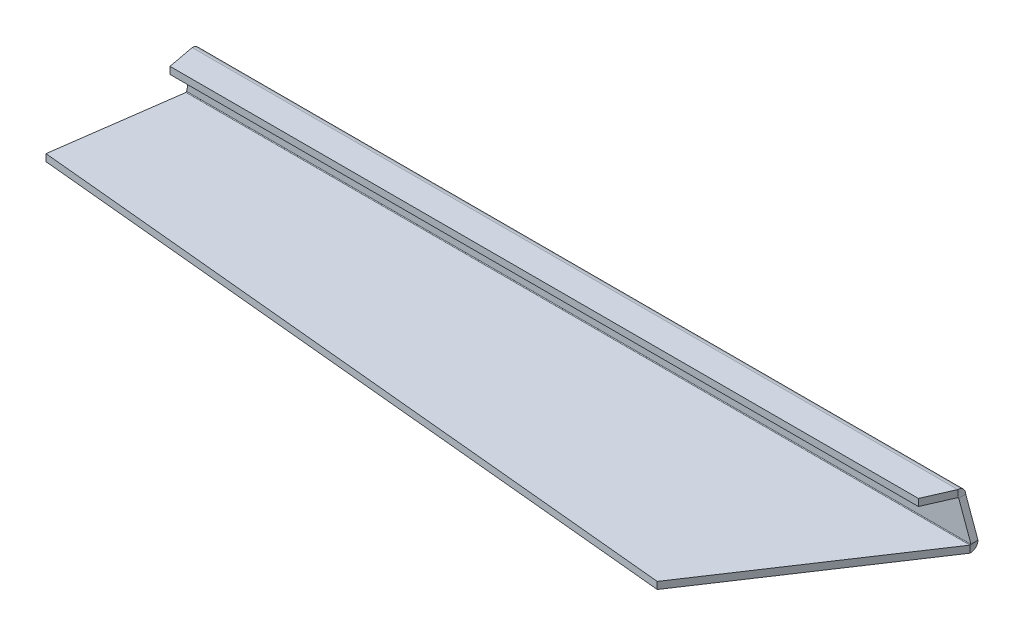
ISO-10303-21;
HEADER;
FILE_DESCRIPTION(('STEP AP214'),'2;1');
FILE_NAME('part.step','',(''),(''),'','','');
FILE_SCHEMA(('AUTOMOTIVE_DESIGN { 1 0 10303 214 1 1 1 1 }'));
ENDSEC;
DATA;
#1=APPLICATION_CONTEXT('core data for automotive mechanical design processes');
#2=APPLICATION_PROTOCOL_DEFINITION('international standard','automotive_design',2000,#1);
#3=PRODUCT_CONTEXT('',#1,'mechanical');
#4=PRODUCT('Part','Part','',(#3));
#5=PRODUCT_RELATED_PRODUCT_CATEGORY('part','',(#4));
#6=PRODUCT_DEFINITION_FORMATION('','',#4);
#7=PRODUCT_DEFINITION_CONTEXT('part definition',#1,'design');
#8=PRODUCT_DEFINITION('design','',#6,#7);
#9=PRODUCT_DEFINITION_SHAPE('','',#8);
#10=(LENGTH_UNIT() NAMED_UNIT(*) SI_UNIT(.MILLI.,.METRE.));
#11=(NAMED_UNIT(*) PLANE_ANGLE_UNIT() SI_UNIT($,.RADIAN.));
#12=(NAMED_UNIT(*) SI_UNIT($,.STERADIAN.) SOLID_ANGLE_UNIT());
#13=UNCERTAINTY_MEASURE_WITH_UNIT(LENGTH_MEASURE(1.E-05),#10,'distance_accuracy_value','');
#14=(GEOMETRIC_REPRESENTATION_CONTEXT(3) GLOBAL_UNCERTAINTY_ASSIGNED_CONTEXT((#13)) GLOBAL_UNIT_ASSIGNED_CONTEXT((#10,
#11,#12)) REPRESENTATION_CONTEXT('',''));
#15=CARTESIAN_POINT('',(0.,0.,0.));
#16=DIRECTION('',(0.,0.,1.));
#17=DIRECTION('',(1.,0.,0.));
#18=AXIS2_PLACEMENT_3D('',#15,#16,#17);
#19=CARTESIAN_POINT('',(-888.,38.5299999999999,8.));
#20=DIRECTION('',(0.983894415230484,-0.178750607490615,0.));
#21=DIRECTION('',(0.178750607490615,0.983894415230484,0.));
#22=AXIS2_PLACEMENT_3D('',#19,#20,#21);
#23=PLANE('',#22);
#24=DIRECTION('',(-0.178750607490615,-0.983894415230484,0.));
#25=VECTOR('',#24,1.);
#26=CARTESIAN_POINT('',(-888.,38.5299999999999,0.));
#27=LINE('',#26,#25);
#28=CARTESIAN_POINT('',(-888.,38.5299999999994,4.84421530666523E-13));
#29=VERTEX_POINT('',#28);
#30=CARTESIAN_POINT('',(-895.,0.,0.));
#31=VERTEX_POINT('',#30);
#32=EDGE_CURVE('E311',#29,#31,#27,.T.);
#33=ORIENTED_EDGE('',*,*,#32,.T.);
#34=DIRECTION('',(0.,0.,-1.));
#35=VECTOR('',#34,1.);
#36=CARTESIAN_POINT('',(-895.,0.,8.));
#37=LINE('',#36,#35);
#38=CARTESIAN_POINT('',(-895.,0.,8.));
#39=VERTEX_POINT('',#38);
#40=EDGE_CURVE('E13',#39,#31,#37,.T.);
#41=ORIENTED_EDGE('',*,*,#40,.F.);
#42=DIRECTION('',(-0.178750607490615,-0.983894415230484,0.));
#43=VECTOR('',#42,1.);
#44=CARTESIAN_POINT('',(-888.,38.5299999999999,8.));
#45=LINE('',#44,#43);
#46=CARTESIAN_POINT('',(-888.,38.5299999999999,8.));
#47=VERTEX_POINT('',#46);
#48=EDGE_CURVE('E327',#47,#39,#45,.T.);
#49=ORIENTED_EDGE('',*,*,#48,.F.);
#50=DIRECTION('',(0.,0.,-1.));
#51=VECTOR('',#50,1.);
#52=CARTESIAN_POINT('',(-888.,38.5299999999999,8.));
#53=LINE('',#52,#51);
#54=EDGE_CURVE('E333',#47,#29,#53,.T.);
#55=ORIENTED_EDGE('',*,*,#54,.T.);
#56=EDGE_LOOP('',(#33,#41,#49,#55));
#57=FACE_BOUND('',#56,.T.);
#58=ADVANCED_FACE('F71',(#57),#23,.F.);
#59=CARTESIAN_POINT('',(0.,0.,8.));
#60=DIRECTION('',(-0.9398788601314,-0.341508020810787,0.));
#61=DIRECTION('',(0.341508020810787,-0.9398788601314,0.));
#62=AXIS2_PLACEMENT_3D('',#59,#60,#61);
#63=PLANE('',#62);
#64=DIRECTION('',(-0.341508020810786,0.9398788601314,0.));
#65=VECTOR('',#64,1.);
#66=CARTESIAN_POINT('',(0.,0.,0.));
#67=LINE('',#66,#65);
#68=CARTESIAN_POINT('',(0.,-3.58091460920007E-13,0.));
#69=VERTEX_POINT('',#68);
#70=CARTESIAN_POINT('',(-14.,38.53,0.));
#71=VERTEX_POINT('',#70);
#72=EDGE_CURVE('E322',#69,#71,#67,.T.);
#73=ORIENTED_EDGE('',*,*,#72,.T.);
#74=DIRECTION('',(0.,0.,-1.));
#75=VECTOR('',#74,1.);
#76=CARTESIAN_POINT('',(-14.,38.53,8.));
#77=LINE('',#76,#75);
#78=CARTESIAN_POINT('',(-14.,38.53,8.));
#79=VERTEX_POINT('',#78);
#80=EDGE_CURVE('E336',#79,#71,#77,.T.);
#81=ORIENTED_EDGE('',*,*,#80,.F.);
#82=DIRECTION('',(-0.341508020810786,0.9398788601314,0.));
#83=VECTOR('',#82,1.);
#84=CARTESIAN_POINT('',(0.,0.,8.));
#85=LINE('',#84,#83);
#86=CARTESIAN_POINT('',(0.,0.,8.));
#87=VERTEX_POINT('',#86);
#88=EDGE_CURVE('E90',#87,#79,#85,.T.);
#89=ORIENTED_EDGE('',*,*,#88,.F.);
#90=DIRECTION('',(0.,0.,-1.));
#91=VECTOR('',#90,1.);
#92=CARTESIAN_POINT('',(0.,0.,8.));
#93=LINE('',#92,#91);
#94=EDGE_CURVE('E78',#87,#69,#93,.T.);
#95=ORIENTED_EDGE('',*,*,#94,.T.);
#96=EDGE_LOOP('',(#73,#81,#89,#95));
#97=FACE_BOUND('',#96,.T.);
#98=ADVANCED_FACE('F341',(#97),#63,.F.);
#99=CARTESIAN_POINT('',(-895.,0.,8.));
#100=DIRECTION('',(0.,0.,1.));
#101=DIRECTION('',(1.,0.,0.));
#102=AXIS2_PLACEMENT_3D('',#99,#100,#101);
#103=PLANE('',#102);
#104=ORIENTED_EDGE('',*,*,#48,.T.);
#105=DIRECTION('',(1.,0.,0.));
#106=VECTOR('',#105,1.);
#107=CARTESIAN_POINT('',(-895.,0.,8.));
#108=LINE('',#107,#106);
#109=EDGE_CURVE('E329',#39,#87,#108,.T.);
#110=ORIENTED_EDGE('',*,*,#109,.T.);
#111=ORIENTED_EDGE('',*,*,#88,.T.);
#112=DIRECTION('',(-1.,0.,0.));
#113=VECTOR('',#112,1.);
#114=CARTESIAN_POINT('',(-14.,38.53,8.));
#115=LINE('',#114,#113);
#116=EDGE_CURVE('E85',#79,#47,#115,.T.);
#117=ORIENTED_EDGE('',*,*,#116,.T.);
#118=EDGE_LOOP('',(#104,#110,#111,#117));
#119=FACE_BOUND('',#118,.T.);
#120=ADVANCED_FACE('F404',(#119),#103,.T.);
#121=CARTESIAN_POINT('',(-895.,0.,0.));
#122=DIRECTION('',(0.,0.,1.));
#123=DIRECTION('',(1.,0.,0.));
#124=AXIS2_PLACEMENT_3D('',#121,#122,#123);
#125=PLANE('',#124);
#126=ORIENTED_EDGE('',*,*,#32,.F.);
#127=DIRECTION('',(-1.,0.,0.));
#128=VECTOR('',#127,1.);
#129=CARTESIAN_POINT('',(-14.,38.53,0.));
#130=LINE('',#129,#128);
#131=EDGE_CURVE('E324',#71,#29,#130,.T.);
#132=ORIENTED_EDGE('',*,*,#131,.F.);
#133=ORIENTED_EDGE('',*,*,#72,.F.);
#134=DIRECTION('',(1.,0.,0.));
#135=VECTOR('',#134,1.);
#136=CARTESIAN_POINT('',(-895.,0.,0.));
#137=LINE('',#136,#135);
#138=EDGE_CURVE('E319',#31,#69,#137,.T.);
#139=ORIENTED_EDGE('',*,*,#138,.F.);
#140=EDGE_LOOP('',(#126,#132,#133,#139));
#141=FACE_BOUND('',#140,.T.);
#142=ADVANCED_FACE('F364',(#141),#125,.F.);
#143=CARTESIAN_POINT('',(-14.,38.5300000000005,-0.0800000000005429));
#144=CARTESIAN_POINT('',(-14.0268600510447,39.6842982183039,-0.0800000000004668));
#145=CARTESIAN_POINT('',(-14.0537104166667,40.8377263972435,0.149472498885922));
#146=CARTESIAN_POINT('',(-14.1074208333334,42.9702071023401,1.03277492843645));
#147=CARTESIAN_POINT('',(-14.1342760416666,43.9482126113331,1.68625731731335));
#148=CARTESIAN_POINT('',(-14.1879864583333,45.5803426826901,3.31838738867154));
#149=CARTESIAN_POINT('',(-14.2148416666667,46.2338250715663,4.29639289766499));
#150=CARTESIAN_POINT('',(-14.2685520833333,47.1171275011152,6.42887360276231));
#151=CARTESIAN_POINT('',(-14.2954024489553,47.3466000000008,7.58230178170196));
#152=CARTESIAN_POINT('',(-14.3222625,47.3466,8.73660000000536));
#153=CARTESIAN_POINT('',(-14.,38.5300000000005,-5.42968447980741E-13));
#154=CARTESIAN_POINT('',(-14.0268600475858,39.6738243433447,-4.67516598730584E-13));
#155=CARTESIAN_POINT('',(-14.0537104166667,40.8167865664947,0.227390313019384));
#156=CARTESIAN_POINT('',(-14.1074208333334,42.9299175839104,1.10267783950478));
#157=CARTESIAN_POINT('',(-14.1342760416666,43.8990488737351,1.75023066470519));
#158=CARTESIAN_POINT('',(-14.1879864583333,45.5163693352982,3.36755112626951));
#159=CARTESIAN_POINT('',(-14.2148416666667,46.1639221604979,4.33668241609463));
#160=CARTESIAN_POINT('',(-14.2685520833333,47.0392096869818,6.44981343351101));
#161=CARTESIAN_POINT('',(-14.2954024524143,47.2666000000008,7.5927756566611));
#162=CARTESIAN_POINT('',(-14.3222625,47.2666,8.73660000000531));
#163=CARTESIAN_POINT('',(-14.,38.53,7.99999999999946));
#164=CARTESIAN_POINT('',(-14.0268597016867,38.6264368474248,7.99999999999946));
#165=CARTESIAN_POINT('',(-14.0537104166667,38.7228034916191,8.0191717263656));
#166=CARTESIAN_POINT('',(-14.1074208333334,38.9009657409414,8.09296894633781));
#167=CARTESIAN_POINT('',(-14.1342760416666,38.9826751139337,8.14756540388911));
#168=CARTESIAN_POINT('',(-14.1879864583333,39.1190345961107,8.28392488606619));
#169=CARTESIAN_POINT('',(-14.2148416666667,39.1736310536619,8.36563425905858));
#170=CARTESIAN_POINT('',(-14.2685520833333,39.247428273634,8.54379650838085));
#171=CARTESIAN_POINT('',(-14.2954027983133,39.2666000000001,8.6401631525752));
#172=CARTESIAN_POINT('',(-14.3222625,39.2666,8.7366));
#173=CARTESIAN_POINT('',(-14.,38.53,8.08079999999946));
#174=CARTESIAN_POINT('',(-14.0268596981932,38.615858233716,8.08079999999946));
#175=CARTESIAN_POINT('',(-14.0537104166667,38.7016542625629,8.0978687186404));
#176=CARTESIAN_POINT('',(-14.1074208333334,38.8602733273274,8.16357088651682));
#177=CARTESIAN_POINT('',(-14.1342760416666,38.9330197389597,8.21217848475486));
#178=CARTESIAN_POINT('',(-14.1879864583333,39.0544215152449,8.33358026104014));
#179=CARTESIAN_POINT('',(-14.2148416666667,39.1030291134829,8.40632667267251));
#180=CARTESIAN_POINT('',(-14.2685520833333,39.1687312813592,8.56494573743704));
#181=CARTESIAN_POINT('',(-14.2954028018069,39.1858000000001,8.65074176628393));
#182=CARTESIAN_POINT('',(-14.3222625,39.1858,8.73659999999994));
#183=B_SPLINE_SURFACE_WITH_KNOTS('',1,3,((#143,#144,#145,#146,#147,#148,#149,#150,#151,#152),
(#153,#154,#155,#156,#157,#158,#159,#160,#161,#162),(#163,#164,#165,#166,#167,#168,#169,#170,
#171,#172),(#173,#174,#175,#176,#177,#178,#179,#180,#181,#182)),.UNSPECIFIED.,.F.,.F.,.F.,(2,1,
1,2),(4,2,2,2,4),(-0.01,0.,1.,1.0101),(0.,0.25,0.5,0.75,1.),.UNSPECIFIED.);
#184=DIRECTION('',(0.,-1.,0.));
#185=VECTOR('',#184,1.);
#186=CARTESIAN_POINT('',(-14.3222625,47.2666,8.73659999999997));
#187=LINE('',#186,#185);
#188=CARTESIAN_POINT('',(-14.3222625,39.2666,8.73659999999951));
#189=VERTEX_POINT('',#188);
#190=CARTESIAN_POINT('',(-14.3222625,47.2666,8.73659999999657));
#191=VERTEX_POINT('',#190);
#192=EDGE_CURVE('E270',#189,#191,#187,.F.);
#193=CARTESIAN_POINT('',(-14.,38.53,7.99999999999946));
#194=CARTESIAN_POINT('',(-14.0033569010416,38.542052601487,7.99999974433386));
#195=CARTESIAN_POINT('',(-14.0067138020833,38.5541051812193,8.00029580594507));
#196=CARTESIAN_POINT('',(-14.0134276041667,38.5781813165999,8.00147872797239));
#197=CARTESIAN_POINT('',(-14.0167845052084,38.5902048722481,8.0023655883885));
#198=CARTESIAN_POINT('',(-14.0234983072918,38.6141939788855,8.00472827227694));
#199=CARTESIAN_POINT('',(-14.0268552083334,38.6261595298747,8.00620409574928));
#200=CARTESIAN_POINT('',(-14.0335690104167,38.650003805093,8.00974106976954));
#201=CARTESIAN_POINT('',(-14.0369259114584,38.6618825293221,8.01180222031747));
#202=CARTESIAN_POINT('',(-14.0436397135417,38.6855245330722,8.01650490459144));
#203=CARTESIAN_POINT('',(-14.0469966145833,38.6972878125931,8.01914643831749));
#204=CARTESIAN_POINT('',(-14.0537104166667,38.7206705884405,8.02500351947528));
#205=CARTESIAN_POINT('',(-14.0570673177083,38.7322900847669,8.02821906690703));
#206=CARTESIAN_POINT('',(-14.0637811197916,38.7553573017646,8.03521643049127));
#207=CARTESIAN_POINT('',(-14.0671380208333,38.7668050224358,8.03899824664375));
#208=CARTESIAN_POINT('',(-14.0738518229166,38.7895011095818,8.04711903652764));
#209=CARTESIAN_POINT('',(-14.0772087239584,38.8007494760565,8.05145801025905));
#210=CARTESIAN_POINT('',(-14.0839225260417,38.8230197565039,8.06068266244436));
#211=CARTESIAN_POINT('',(-14.0872794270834,38.8340416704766,8.06556834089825));
#212=CARTESIAN_POINT('',(-14.0939932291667,38.8558324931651,8.07587463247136));
#213=CARTESIAN_POINT('',(-14.0973501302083,38.866601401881,8.08129524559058));
#214=CARTESIAN_POINT('',(-14.1040639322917,38.8878602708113,8.09265834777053));
#215=CARTESIAN_POINT('',(-14.1074208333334,38.8983502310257,8.09860083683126));
#216=CARTESIAN_POINT('',(-14.1141346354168,38.9190259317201,8.11099337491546));
#217=CARTESIAN_POINT('',(-14.1174915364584,38.9292116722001,8.11744342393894));
#218=CARTESIAN_POINT('',(-14.1242053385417,38.9492543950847,8.13083554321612));
#219=CARTESIAN_POINT('',(-14.1275622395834,38.9591113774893,8.13777761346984));
#220=CARTESIAN_POINT('',(-14.1342760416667,38.9784728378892,8.15213705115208));
#221=CARTESIAN_POINT('',(-14.1376329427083,38.9879773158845,8.1595544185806));
#222=CARTESIAN_POINT('',(-14.1443467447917,39.0066108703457,8.17484658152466));
#223=CARTESIAN_POINT('',(-14.1477036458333,39.0157399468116,8.1827213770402));
#224=CARTESIAN_POINT('',(-14.1544174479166,39.0336007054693,8.19890942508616));
#225=CARTESIAN_POINT('',(-14.1577743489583,39.0423323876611,8.20722267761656));
#226=CARTESIAN_POINT('',(-14.1644881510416,39.0593773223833,8.22426761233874));
#227=CARTESIAN_POINT('',(-14.1678450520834,39.0676905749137,8.23299929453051));
#228=CARTESIAN_POINT('',(-14.1745588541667,39.0838786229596,8.25086005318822));
#229=CARTESIAN_POINT('',(-14.1779157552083,39.0917534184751,8.25998912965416));
#230=CARTESIAN_POINT('',(-14.1846295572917,39.1070455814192,8.27862268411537));
#231=CARTESIAN_POINT('',(-14.1879864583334,39.1144629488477,8.28812716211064));
#232=CARTESIAN_POINT('',(-14.1947002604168,39.1288223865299,8.30748862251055));
#233=CARTESIAN_POINT('',(-14.1980571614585,39.1357644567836,8.31734560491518));
#234=CARTESIAN_POINT('',(-14.2047709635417,39.1491565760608,8.33738832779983));
#235=CARTESIAN_POINT('',(-14.2081278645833,39.1556066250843,8.34757406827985));
#236=CARTESIAN_POINT('',(-14.2148416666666,39.1679991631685,8.36824976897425));
#237=CARTESIAN_POINT('',(-14.2181985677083,39.1739416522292,8.37873972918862));
#238=CARTESIAN_POINT('',(-14.2249123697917,39.1853047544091,8.39999859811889));
#239=CARTESIAN_POINT('',(-14.2282692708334,39.1907253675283,8.41076750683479));
#240=CARTESIAN_POINT('',(-14.2349830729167,39.2010316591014,8.43255832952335));
#241=CARTESIAN_POINT('',(-14.2383399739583,39.2059173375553,8.44358024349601));
#242=CARTESIAN_POINT('',(-14.2450537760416,39.2151419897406,8.46585052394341));
#243=CARTESIAN_POINT('',(-14.2484106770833,39.219480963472,8.47709889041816));
#244=CARTESIAN_POINT('',(-14.2551244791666,39.2276017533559,8.49979497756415));
#245=CARTESIAN_POINT('',(-14.2584813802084,39.2313835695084,8.51124269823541));
#246=CARTESIAN_POINT('',(-14.2651951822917,39.2383809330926,8.53430991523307));
#247=CARTESIAN_POINT('',(-14.2685520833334,39.2415964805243,8.54592941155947));
#248=CARTESIAN_POINT('',(-14.2752658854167,39.2474535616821,8.56931218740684));
#249=CARTESIAN_POINT('',(-14.2786227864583,39.2500950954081,8.58107546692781));
#250=CARTESIAN_POINT('',(-14.2853365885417,39.2547977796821,8.60471747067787));
#251=CARTESIAN_POINT('',(-14.2886934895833,39.25685893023,8.61659619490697));
#252=CARTESIAN_POINT('',(-14.2954072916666,39.2603959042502,8.64044047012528));
#253=CARTESIAN_POINT('',(-14.2987641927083,39.2618717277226,8.6524060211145));
#254=CARTESIAN_POINT('',(-14.3054779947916,39.264234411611,8.67639512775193));
#255=CARTESIAN_POINT('',(-14.3088348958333,39.2651212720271,8.68841868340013));
#256=CARTESIAN_POINT('',(-14.3155486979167,39.2663041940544,8.71249481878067));
#257=CARTESIAN_POINT('',(-14.3189055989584,39.2666002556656,8.72454739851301));
#258=CARTESIAN_POINT('',(-14.3222625,39.2666,8.7366));
#259=B_SPLINE_CURVE_WITH_KNOTS('',3,(#193,#194,#195,#196,#197,#198,#199,#200,#201,#202,#203,
#204,#205,#206,#207,#208,#209,#210,#211,#212,#213,#214,#215,#216,#217,#218,#219,#220,#221,#222,
#223,#224,#225,#226,#227,#228,#229,#230,#231,#232,#233,#234,#235,#236,#237,#238,#239,#240,#241,
#242,#243,#244,#245,#246,#247,#248,#249,#250,#251,#252,#253,#254,#255,#256,#257,#258),
.UNSPECIFIED.,.F.,.F.,(4,2,2,2,2,2,2,2,2,2,2,2,2,2,2,2,2,2,2,2,2,2,2,2,2,2,2,2,2,2,2,2,4),(0.,
0.0375305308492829,0.0750610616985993,0.112591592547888,0.150122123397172,0.187652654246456,
0.225183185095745,0.262713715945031,0.300244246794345,0.337774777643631,0.375305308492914,
0.412835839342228,0.450366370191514,0.487896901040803,0.525427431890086,0.562957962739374,
0.600488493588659,0.638019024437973,0.675549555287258,0.713080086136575,0.750610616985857,
0.788141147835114,0.825671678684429,0.863202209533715,0.900732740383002,0.938263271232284,
0.975793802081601,1.01332433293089,1.05085486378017,1.08838539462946,1.12591592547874,
1.16344645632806,1.20097698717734),.UNSPECIFIED.);
#260=EDGE_CURVE('E273',#79,#189,#259,.T.);
#261=CARTESIAN_POINT('',(-14.,38.5300000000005,-5.44703171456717E-13));
#262=CARTESIAN_POINT('',(-14.0033569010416,38.6729524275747,-3.03237632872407E-06));
#263=CARTESIAN_POINT('',(-14.0067138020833,38.8159045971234,0.00350846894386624));
#264=CARTESIAN_POINT('',(-14.0134276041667,39.1014646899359,0.0175387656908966));
#265=CARTESIAN_POINT('',(-14.0167845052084,39.2440726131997,0.0280575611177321));
#266=CARTESIAN_POINT('',(-14.0234983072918,39.5286004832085,0.0560806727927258));
#267=CARTESIAN_POINT('',(-14.0268552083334,39.6705204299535,0.073584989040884));
#268=CARTESIAN_POINT('',(-14.0335690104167,39.9533304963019,0.11553601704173));
#269=CARTESIAN_POINT('',(-14.0369259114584,40.0942206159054,0.139982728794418));
#270=CARTESIAN_POINT('',(-14.0436397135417,40.3746315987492,0.195759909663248));
#271=CARTESIAN_POINT('',(-14.0469966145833,40.5141524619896,0.22709037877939));
#272=CARTESIAN_POINT('',(-14.0537104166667,40.7914888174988,0.296559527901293));
#273=CARTESIAN_POINT('',(-14.0570673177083,40.9293043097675,0.334698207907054));
#274=CARTESIAN_POINT('',(-14.0637811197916,41.202897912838,0.417691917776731));
#275=CARTESIAN_POINT('',(-14.0671380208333,41.3386760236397,0.462546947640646));
#276=CARTESIAN_POINT('',(-14.0738518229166,41.6078677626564,0.558865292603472));
#277=CARTESIAN_POINT('',(-14.0772087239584,41.7412813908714,0.610328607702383));
#278=CARTESIAN_POINT('',(-14.0839225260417,42.0054227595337,0.719739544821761));
#279=CARTESIAN_POINT('',(-14.0872794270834,42.1361504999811,0.777687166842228));
#280=CARTESIAN_POINT('',(-14.0939932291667,42.3946051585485,0.899927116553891));
#281=CARTESIAN_POINT('',(-14.0973501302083,42.5223320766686,0.964219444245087));
#282=CARTESIAN_POINT('',(-14.1040639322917,42.7744773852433,1.09899391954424));
#283=CARTESIAN_POINT('',(-14.1074208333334,42.898895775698,1.16947606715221));
#284=CARTESIAN_POINT('',(-14.1141346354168,43.144124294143,1.3164603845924));
#285=CARTESIAN_POINT('',(-14.1174915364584,43.2649344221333,1.39296255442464));
#286=CARTESIAN_POINT('',(-14.1242053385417,43.502655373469,1.55180261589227));
#287=CARTESIAN_POINT('',(-14.1275622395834,43.6195661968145,1.63414050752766));
#288=CARTESIAN_POINT('',(-14.1342760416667,43.849206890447,1.80445365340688));
#289=CARTESIAN_POINT('',(-14.1376329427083,43.9619367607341,1.89242890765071));
#290=CARTESIAN_POINT('',(-14.1443467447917,44.1829439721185,2.07380483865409));
#291=CARTESIAN_POINT('',(-14.1477036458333,44.2912213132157,2.16720551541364));
#292=CARTESIAN_POINT('',(-14.1544174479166,44.5030626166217,2.35920728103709));
#293=CARTESIAN_POINT('',(-14.1577743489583,44.6066265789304,2.457808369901));
#294=CARTESIAN_POINT('',(-14.1644881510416,44.8087916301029,2.65997342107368));
#295=CARTESIAN_POINT('',(-14.1678450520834,44.9073927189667,2.76353738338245));
#296=CARTESIAN_POINT('',(-14.1745588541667,45.09939448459,2.97537868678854));
#297=CARTESIAN_POINT('',(-14.1779157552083,45.1927951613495,3.08365602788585));
#298=CARTESIAN_POINT('',(-14.1846295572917,45.3741710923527,3.30466323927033));
#299=CARTESIAN_POINT('',(-14.1879864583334,45.4621463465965,3.4173931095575));
#300=CARTESIAN_POINT('',(-14.1947002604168,45.6324594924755,3.64703380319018));
#301=CARTESIAN_POINT('',(-14.1980571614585,45.7147973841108,3.7639446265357));
#302=CARTESIAN_POINT('',(-14.2047709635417,45.8736374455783,4.00166557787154));
#303=CARTESIAN_POINT('',(-14.2081278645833,45.9501396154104,4.12247570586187));
#304=CARTESIAN_POINT('',(-14.2148416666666,46.0971239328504,4.36770422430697));
#305=CARTESIAN_POINT('',(-14.2181985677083,46.1676060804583,4.49212261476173));
#306=CARTESIAN_POINT('',(-14.2249123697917,46.3023805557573,4.74426792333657));
#307=CARTESIAN_POINT('',(-14.2282692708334,46.3666728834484,4.87199484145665));
#308=CARTESIAN_POINT('',(-14.2349830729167,46.4889128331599,5.13044950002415));
#309=CARTESIAN_POINT('',(-14.2383399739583,46.5468604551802,5.26117724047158));
#310=CARTESIAN_POINT('',(-14.2450537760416,46.6562713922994,5.52531860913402));
#311=CARTESIAN_POINT('',(-14.2484106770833,46.7077347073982,5.65873223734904));
#312=CARTESIAN_POINT('',(-14.2551244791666,46.8040530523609,5.92792397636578));
#313=CARTESIAN_POINT('',(-14.2584813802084,46.8489080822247,6.0637020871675));
#314=CARTESIAN_POINT('',(-14.2651951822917,46.9319017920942,6.33729569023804));
#315=CARTESIAN_POINT('',(-14.2685520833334,46.9700404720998,6.47511118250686));
#316=CARTESIAN_POINT('',(-14.2752658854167,47.0395096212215,6.7524475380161));
#317=CARTESIAN_POINT('',(-14.2786227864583,47.0708400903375,6.89196840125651));
#318=CARTESIAN_POINT('',(-14.2853365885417,47.1266172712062,7.17237938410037));
#319=CARTESIAN_POINT('',(-14.2886934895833,47.1510639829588,7.31326950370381));
#320=CARTESIAN_POINT('',(-14.2954072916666,47.1930150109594,7.59607957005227));
#321=CARTESIAN_POINT('',(-14.2987641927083,47.2105193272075,7.73799951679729));
#322=CARTESIAN_POINT('',(-14.3054779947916,47.2385424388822,8.02252738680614));
#323=CARTESIAN_POINT('',(-14.3088348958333,47.249061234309,8.16513531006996));
#324=CARTESIAN_POINT('',(-14.3155486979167,47.2630915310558,8.45069540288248));
#325=CARTESIAN_POINT('',(-14.3189055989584,47.2666030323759,8.59364757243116));
#326=CARTESIAN_POINT('',(-14.3222625,47.2666,8.73660000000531));
#327=B_SPLINE_CURVE_WITH_KNOTS('',3,(#261,#262,#263,#264,#265,#266,#267,#268,#269,#270,#271,
#272,#273,#274,#275,#276,#277,#278,#279,#280,#281,#282,#283,#284,#285,#286,#287,#288,#289,#290,
#291,#292,#293,#294,#295,#296,#297,#298,#299,#300,#301,#302,#303,#304,#305,#306,#307,#308,#309,
#310,#311,#312,#313,#314,#315,#316,#317,#318,#319,#320,#321,#322,#323,#324,#325,#326),
.UNSPECIFIED.,.F.,.F.,(4,2,2,2,2,2,2,2,2,2,2,2,2,2,2,2,2,2,2,2,2,2,2,2,2,2,2,2,2,2,2,2,4),(0.,
0.428932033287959,0.857864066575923,1.28679609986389,1.71572813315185,2.14466016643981,
2.57359219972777,3.00252423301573,3.43145626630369,3.86038829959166,4.28932033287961,
4.71825236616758,5.14718439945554,5.5761164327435,6.00504846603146,6.43398049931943,
6.86291253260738,7.29184456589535,7.72077659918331,8.14970863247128,8.57864066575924,
9.00757269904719,9.43650473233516,9.86543676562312,10.2943687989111,10.723300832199,
11.152232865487,11.581164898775,12.0100969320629,12.4390289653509,12.8679609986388,
13.2968930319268,13.7258250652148),.UNSPECIFIED.);
#328=EDGE_CURVE('E279',#71,#191,#327,.T.);
#329=ORIENTED_EDGE('',*,*,#192,.F.);
#330=ORIENTED_EDGE('',*,*,#260,.F.);
#331=ORIENTED_EDGE('',*,*,#80,.T.);
#332=ORIENTED_EDGE('',*,*,#328,.T.);
#333=EDGE_LOOP('',(#329,#330,#331,#332));
#334=FACE_BOUND('',#333,.T.);
#335=ADVANCED_FACE('F370',(#334),#183,.F.);
#336=CARTESIAN_POINT('',(-887.8618875,47.3466,8.73659999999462));
#337=CARTESIAN_POINT('',(-887.873398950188,47.3465999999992,7.58230169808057));
#338=CARTESIAN_POINT('',(-887.88490625,47.1171275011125,6.42887360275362));
#339=CARTESIAN_POINT('',(-887.907925,46.233825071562,4.29639289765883));
#340=CARTESIAN_POINT('',(-887.919434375,45.5803426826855,3.31838738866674));
#341=CARTESIAN_POINT('',(-887.942453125,43.9482126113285,1.686257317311));
#342=CARTESIAN_POINT('',(-887.9539625,42.9702071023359,1.03277492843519));
#343=CARTESIAN_POINT('',(-887.97698125,40.8377263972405,0.149472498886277));
#344=CARTESIAN_POINT('',(-887.988488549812,39.6842983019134,-0.0799999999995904));
#345=CARTESIAN_POINT('',(-888.,38.5299999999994,-0.0799999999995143));
#346=CARTESIAN_POINT('',(-887.8618875,47.2666,8.73659999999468));
#347=CARTESIAN_POINT('',(-887.873398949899,47.2665999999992,7.59277556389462));
#348=CARTESIAN_POINT('',(-887.88490625,47.039209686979,6.4498134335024));
#349=CARTESIAN_POINT('',(-887.907925,46.1639221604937,4.33668241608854));
#350=CARTESIAN_POINT('',(-887.919434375,45.5163693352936,3.36755112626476));
#351=CARTESIAN_POINT('',(-887.942453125,43.8990488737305,1.75023066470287));
#352=CARTESIAN_POINT('',(-887.9539625,42.9299175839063,1.10267783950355));
#353=CARTESIAN_POINT('',(-887.97698125,40.8167865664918,0.227390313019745));
#354=CARTESIAN_POINT('',(-887.988488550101,39.6738244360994,4.10277854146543E-13));
#355=CARTESIAN_POINT('',(-888.,38.5299999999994,4.85722573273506E-13));
#356=CARTESIAN_POINT('',(-887.8618875,39.2666,8.73660000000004));
#357=CARTESIAN_POINT('',(-887.873398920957,39.2665999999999,8.6401621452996));
#358=CARTESIAN_POINT('',(-887.88490625,39.2474282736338,8.54379650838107));
#359=CARTESIAN_POINT('',(-887.907925,39.1736310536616,8.36563425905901));
#360=CARTESIAN_POINT('',(-887.919434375,39.1190345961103,8.28392488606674));
#361=CARTESIAN_POINT('',(-887.942453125,38.9826751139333,8.14756540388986));
#362=CARTESIAN_POINT('',(-887.9539625,38.900965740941,8.09296894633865));
#363=CARTESIAN_POINT('',(-887.97698125,38.7228034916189,8.01917172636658));
#364=CARTESIAN_POINT('',(-887.988488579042,38.6264378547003,8.00000000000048));
#365=CARTESIAN_POINT('',(-888.,38.5299999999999,8.00000000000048));
#366=CARTESIAN_POINT('',(-887.8618875,39.1858,8.7366000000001));
#367=CARTESIAN_POINT('',(-887.873398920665,39.1857999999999,8.65074074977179));
#368=CARTESIAN_POINT('',(-887.88490625,39.168731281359,8.56494573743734));
#369=CARTESIAN_POINT('',(-887.907925,39.1030291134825,8.40632667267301));
#370=CARTESIAN_POINT('',(-887.919434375,39.0544215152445,8.33358026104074));
#371=CARTESIAN_POINT('',(-887.942453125,38.9330197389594,8.21217848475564));
#372=CARTESIAN_POINT('',(-887.9539625,38.8602733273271,8.16357088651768));
#373=CARTESIAN_POINT('',(-887.97698125,38.7016542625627,8.09786871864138));
#374=CARTESIAN_POINT('',(-887.988488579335,38.6158592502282,8.08080000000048));
#375=CARTESIAN_POINT('',(-888.,38.5299999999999,8.08080000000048));
#376=B_SPLINE_SURFACE_WITH_KNOTS('',1,3,((#336,#337,#338,#339,#340,#341,#342,#343,#344,#345),
(#346,#347,#348,#349,#350,#351,#352,#353,#354,#355),(#356,#357,#358,#359,#360,#361,#362,#363,
#364,#365),(#366,#367,#368,#369,#370,#371,#372,#373,#374,#375)),.UNSPECIFIED.,.F.,.F.,.F.,(2,1,
1,2),(4,2,2,2,4),(-0.01,0.,1.,1.0101),(0.,0.25,0.5,0.75,1.),.UNSPECIFIED.);
#377=CARTESIAN_POINT('',(-887.8618875,39.2666,8.73660000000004));
#378=CARTESIAN_POINT('',(-887.863326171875,39.2666002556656,8.72454739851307));
#379=CARTESIAN_POINT('',(-887.86476484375,39.2663041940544,8.71249481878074));
#380=CARTESIAN_POINT('',(-887.8676421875,39.265121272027,8.68841868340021));
#381=CARTESIAN_POINT('',(-887.869080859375,39.2642344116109,8.67639512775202));
#382=CARTESIAN_POINT('',(-887.871958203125,39.2618717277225,8.65240602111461));
#383=CARTESIAN_POINT('',(-887.873396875,39.2603959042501,8.64044047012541));
#384=CARTESIAN_POINT('',(-887.87627421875,39.2568589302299,8.61659619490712));
#385=CARTESIAN_POINT('',(-887.877712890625,39.2547977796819,8.60471747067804));
#386=CARTESIAN_POINT('',(-887.880590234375,39.2500950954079,8.581075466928));
#387=CARTESIAN_POINT('',(-887.88202890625,39.2474535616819,8.56931218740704));
#388=CARTESIAN_POINT('',(-887.88490625,39.2415964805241,8.5459294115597));
#389=CARTESIAN_POINT('',(-887.886344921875,39.2383809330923,8.53430991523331));
#390=CARTESIAN_POINT('',(-887.889222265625,39.2313835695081,8.51124269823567));
#391=CARTESIAN_POINT('',(-887.8906609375,39.2276017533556,8.49979497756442));
#392=CARTESIAN_POINT('',(-887.89353828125,39.2194809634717,8.47709889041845));
#393=CARTESIAN_POINT('',(-887.894976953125,39.2151419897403,8.46585052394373));
#394=CARTESIAN_POINT('',(-887.897854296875,39.205917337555,8.44358024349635));
#395=CARTESIAN_POINT('',(-887.89929296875,39.2010316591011,8.4325583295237));
#396=CARTESIAN_POINT('',(-887.9021703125,39.190725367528,8.41076750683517));
#397=CARTESIAN_POINT('',(-887.903608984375,39.1853047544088,8.39999859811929));
#398=CARTESIAN_POINT('',(-887.906486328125,39.1739416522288,8.37873972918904));
#399=CARTESIAN_POINT('',(-887.907925,39.1679991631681,8.36824976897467));
#400=CARTESIAN_POINT('',(-887.91080234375,39.1556066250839,8.34757406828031));
#401=CARTESIAN_POINT('',(-887.912241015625,39.1491565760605,8.3373883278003));
#402=CARTESIAN_POINT('',(-887.915118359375,39.1357644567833,8.31734560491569));
#403=CARTESIAN_POINT('',(-887.91655703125,39.1288223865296,8.30748862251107));
#404=CARTESIAN_POINT('',(-887.919434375,39.1144629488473,8.28812716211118));
#405=CARTESIAN_POINT('',(-887.920873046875,39.1070455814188,8.27862268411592));
#406=CARTESIAN_POINT('',(-887.923750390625,39.0917534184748,8.25998912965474));
#407=CARTESIAN_POINT('',(-887.9251890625,39.0838786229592,8.25086005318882));
#408=CARTESIAN_POINT('',(-887.92806640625,39.0676905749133,8.23299929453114));
#409=CARTESIAN_POINT('',(-887.929505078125,39.0593773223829,8.22426761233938));
#410=CARTESIAN_POINT('',(-887.932382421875,39.0423323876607,8.20722267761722));
#411=CARTESIAN_POINT('',(-887.93382109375,39.0336007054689,8.19890942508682));
#412=CARTESIAN_POINT('',(-887.9366984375,39.0157399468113,8.1827213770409));
#413=CARTESIAN_POINT('',(-887.938137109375,39.0066108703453,8.17484658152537));
#414=CARTESIAN_POINT('',(-887.941014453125,38.9879773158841,8.15955441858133));
#415=CARTESIAN_POINT('',(-887.942453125,38.9784728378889,8.15213705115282));
#416=CARTESIAN_POINT('',(-887.94533046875,38.959111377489,8.13777761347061));
#417=CARTESIAN_POINT('',(-887.946769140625,38.9492543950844,8.1308355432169));
#418=CARTESIAN_POINT('',(-887.949646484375,38.9292116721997,8.11744342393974));
#419=CARTESIAN_POINT('',(-887.95108515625,38.9190259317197,8.11099337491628));
#420=CARTESIAN_POINT('',(-887.9539625,38.8983502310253,8.0986008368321));
#421=CARTESIAN_POINT('',(-887.955401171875,38.887860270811,8.09265834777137));
#422=CARTESIAN_POINT('',(-887.958278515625,38.8666014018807,8.08129524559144));
#423=CARTESIAN_POINT('',(-887.9597171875,38.8558324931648,8.07587463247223));
#424=CARTESIAN_POINT('',(-887.96259453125,38.8340416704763,8.06556834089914));
#425=CARTESIAN_POINT('',(-887.964033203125,38.8230197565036,8.06068266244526));
#426=CARTESIAN_POINT('',(-887.966910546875,38.8007494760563,8.05145801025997));
#427=CARTESIAN_POINT('',(-887.96834921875,38.7895011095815,8.04711903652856));
#428=CARTESIAN_POINT('',(-887.9712265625,38.7668050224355,8.03899824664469));
#429=CARTESIAN_POINT('',(-887.972665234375,38.7553573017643,8.03521643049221));
#430=CARTESIAN_POINT('',(-887.975542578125,38.7322900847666,8.02821906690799));
#431=CARTESIAN_POINT('',(-887.97698125,38.7206705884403,8.02500351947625));
#432=CARTESIAN_POINT('',(-887.97985859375,38.6972878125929,8.01914643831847));
#433=CARTESIAN_POINT('',(-887.981297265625,38.685524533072,8.01650490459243));
#434=CARTESIAN_POINT('',(-887.984174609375,38.6618825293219,8.01180222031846));
#435=CARTESIAN_POINT('',(-887.98561328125,38.6500038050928,8.00974106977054));
#436=CARTESIAN_POINT('',(-887.988490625,38.6261595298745,8.00620409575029));
#437=CARTESIAN_POINT('',(-887.989929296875,38.6141939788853,8.00472827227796));
#438=CARTESIAN_POINT('',(-887.992806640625,38.5902048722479,8.00236558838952));
#439=CARTESIAN_POINT('',(-887.9942453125,38.5781813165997,8.00147872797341));
#440=CARTESIAN_POINT('',(-887.99712265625,38.5541051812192,8.00029580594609));
#441=CARTESIAN_POINT('',(-887.998561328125,38.5420526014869,7.99999974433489));
#442=CARTESIAN_POINT('',(-888.,38.5299999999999,8.00000000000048));
#443=B_SPLINE_CURVE_WITH_KNOTS('',3,(#377,#378,#379,#380,#381,#382,#383,#384,#385,#386,#387,
#388,#389,#390,#391,#392,#393,#394,#395,#396,#397,#398,#399,#400,#401,#402,#403,#404,#405,#406,
#407,#408,#409,#410,#411,#412,#413,#414,#415,#416,#417,#418,#419,#420,#421,#422,#423,#424,#425,
#426,#427,#428,#429,#430,#431,#432,#433,#434,#435,#436,#437,#438,#439,#440,#441,#442),
.UNSPECIFIED.,.F.,.F.,(4,2,2,2,2,2,2,2,2,2,2,2,2,2,2,2,2,2,2,2,2,2,2,2,2,2,2,2,2,2,2,2,4),(0.,
0.0364108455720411,0.0728216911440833,0.109232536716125,0.145643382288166,0.182054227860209,
0.21846507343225,0.254875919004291,0.291286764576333,0.327697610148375,0.364108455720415,
0.400519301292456,0.4369301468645,0.473340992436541,0.50975183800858,0.546162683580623,
0.582573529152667,0.618984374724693,0.655395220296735,0.691806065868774,0.728216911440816,
0.764627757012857,0.801038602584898,0.83744944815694,0.873860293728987,0.910271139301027,
0.94668198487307,0.983092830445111,1.01950367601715,1.05591452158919,1.09232536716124,
1.12873621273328,1.16514705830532),.UNSPECIFIED.);
#444=CARTESIAN_POINT('',(-887.8618875,39.2666,8.73660000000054));
#445=VERTEX_POINT('',#444);
#446=EDGE_CURVE('E245',#445,#47,#443,.T.);
#447=DIRECTION('',(0.,-1.,0.));
#448=VECTOR('',#447,1.);
#449=CARTESIAN_POINT('',(-887.8618875,39.2665999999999,8.73660000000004));
#450=LINE('',#449,#448);
#451=CARTESIAN_POINT('',(-887.8618875,47.2665999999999,8.73660000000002));
#452=VERTEX_POINT('',#451);
#453=EDGE_CURVE('E265',#445,#452,#450,.F.);
#454=CARTESIAN_POINT('',(-887.8618875,47.2666,8.73659999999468));
#455=CARTESIAN_POINT('',(-887.863326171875,47.2666030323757,8.59364757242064));
#456=CARTESIAN_POINT('',(-887.86476484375,47.2630915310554,8.45069540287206));
#457=CARTESIAN_POINT('',(-887.8676421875,47.2490612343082,8.16513531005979));
#458=CARTESIAN_POINT('',(-887.869080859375,47.2385424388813,8.02252738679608));
#459=CARTESIAN_POINT('',(-887.871958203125,47.2105193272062,7.73799951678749));
#460=CARTESIAN_POINT('',(-887.873396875,47.193015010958,7.5960795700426));
#461=CARTESIAN_POINT('',(-887.87627421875,47.151063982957,7.31326950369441));
#462=CARTESIAN_POINT('',(-887.877712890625,47.1266172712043,7.17237938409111));
#463=CARTESIAN_POINT('',(-887.880590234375,47.0708400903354,6.89196840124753));
#464=CARTESIAN_POINT('',(-887.88202890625,47.0395096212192,6.75244753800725));
#465=CARTESIAN_POINT('',(-887.88490625,46.9700404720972,6.47511118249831));
#466=CARTESIAN_POINT('',(-887.886344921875,46.9319017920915,6.33729569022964));
#467=CARTESIAN_POINT('',(-887.889222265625,46.8489080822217,6.06370208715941));
#468=CARTESIAN_POINT('',(-887.8906609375,46.8040530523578,5.92792397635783));
#469=CARTESIAN_POINT('',(-887.89353828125,46.707734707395,5.6587322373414));
#470=CARTESIAN_POINT('',(-887.894976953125,46.656271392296,5.52531860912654));
#471=CARTESIAN_POINT('',(-887.897854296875,46.5468604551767,5.26117724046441));
#472=CARTESIAN_POINT('',(-887.89929296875,46.4889128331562,5.13044950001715));
#473=CARTESIAN_POINT('',(-887.9021703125,46.3666728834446,4.87199484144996));
#474=CARTESIAN_POINT('',(-887.903608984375,46.3023805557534,4.74426792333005));
#475=CARTESIAN_POINT('',(-887.906486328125,46.1676060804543,4.49212261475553));
#476=CARTESIAN_POINT('',(-887.907925,46.0971239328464,4.36770422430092));
#477=CARTESIAN_POINT('',(-887.91080234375,45.9501396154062,4.12247570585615));
#478=CARTESIAN_POINT('',(-887.912241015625,45.873637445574,4.00166557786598));
#479=CARTESIAN_POINT('',(-887.915118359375,45.7147973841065,3.76394462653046));
#480=CARTESIAN_POINT('',(-887.91655703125,45.6324594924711,3.64703380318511));
#481=CARTESIAN_POINT('',(-887.919434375,45.462146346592,3.41739310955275));
#482=CARTESIAN_POINT('',(-887.920873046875,45.3741710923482,3.30466323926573));
#483=CARTESIAN_POINT('',(-887.923750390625,45.192795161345,3.08365602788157));
#484=CARTESIAN_POINT('',(-887.9251890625,45.0993944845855,2.97537868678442));
#485=CARTESIAN_POINT('',(-887.92806640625,44.9073927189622,2.76353738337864));
#486=CARTESIAN_POINT('',(-887.929505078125,44.8087916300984,2.65997342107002));
#487=CARTESIAN_POINT('',(-887.932382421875,44.6066265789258,2.45780836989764));
#488=CARTESIAN_POINT('',(-887.93382109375,44.5030626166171,2.35920728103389));
#489=CARTESIAN_POINT('',(-887.9366984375,44.2912213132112,2.16720551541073));
#490=CARTESIAN_POINT('',(-887.938137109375,44.182943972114,2.07380483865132));
#491=CARTESIAN_POINT('',(-887.941014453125,43.9619367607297,1.89242890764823));
#492=CARTESIAN_POINT('',(-887.942453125,43.8492068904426,1.80445365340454));
#493=CARTESIAN_POINT('',(-887.94533046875,43.6195661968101,1.6341405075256));
#494=CARTESIAN_POINT('',(-887.946769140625,43.5026553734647,1.55180261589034));
#495=CARTESIAN_POINT('',(-887.949646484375,43.2649344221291,1.39296255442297));
#496=CARTESIAN_POINT('',(-887.95108515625,43.1441242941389,1.31646038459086));
#497=CARTESIAN_POINT('',(-887.9539625,42.898895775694,1.16947606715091));
#498=CARTESIAN_POINT('',(-887.955401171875,42.7744773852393,1.09899391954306));
#499=CARTESIAN_POINT('',(-887.958278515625,42.5223320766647,0.964219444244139));
#500=CARTESIAN_POINT('',(-887.9597171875,42.3946051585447,0.899927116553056));
#501=CARTESIAN_POINT('',(-887.96259453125,42.1361504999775,0.777687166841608));
#502=CARTESIAN_POINT('',(-887.964033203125,42.0054227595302,0.719739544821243));
#503=CARTESIAN_POINT('',(-887.966910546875,41.741281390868,0.610328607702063));
#504=CARTESIAN_POINT('',(-887.96834921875,41.6078677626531,0.558865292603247));
#505=CARTESIAN_POINT('',(-887.9712265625,41.3386760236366,0.462546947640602));
#506=CARTESIAN_POINT('',(-887.972665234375,41.2028979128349,0.417691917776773));
#507=CARTESIAN_POINT('',(-887.975542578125,40.9293043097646,0.334698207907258));
#508=CARTESIAN_POINT('',(-887.97698125,40.791488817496,0.296559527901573));
#509=CARTESIAN_POINT('',(-887.97985859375,40.514152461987,0.227090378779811));
#510=CARTESIAN_POINT('',(-887.981297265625,40.3746315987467,0.195759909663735));
#511=CARTESIAN_POINT('',(-887.984174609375,40.094220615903,0.139982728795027));
#512=CARTESIAN_POINT('',(-887.98561328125,39.9533304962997,0.115536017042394));
#513=CARTESIAN_POINT('',(-887.988490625,39.6705204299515,0.0735849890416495));
#514=CARTESIAN_POINT('',(-887.989929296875,39.5286004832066,0.0560806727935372));
#515=CARTESIAN_POINT('',(-887.992806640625,39.244072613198,0.028057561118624));
#516=CARTESIAN_POINT('',(-887.9942453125,39.1014646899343,0.0175387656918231));
#517=CARTESIAN_POINT('',(-887.99712265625,38.815904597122,0.00350846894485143));
#518=CARTESIAN_POINT('',(-887.998561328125,38.6729524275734,-3.03237531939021E-06));
#519=CARTESIAN_POINT('',(-888.,38.5299999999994,4.83987849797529E-13));
#520=B_SPLINE_CURVE_WITH_KNOTS('',3,(#454,#455,#456,#457,#458,#459,#460,#461,#462,#463,#464,
#465,#466,#467,#468,#469,#470,#471,#472,#473,#474,#475,#476,#477,#478,#479,#480,#481,#482,#483,
#484,#485,#486,#487,#488,#489,#490,#491,#492,#493,#494,#495,#496,#497,#498,#499,#500,#501,#502,
#503,#504,#505,#506,#507,#508,#509,#510,#511,#512,#513,#514,#515,#516,#517,#518,#519),
.UNSPECIFIED.,.F.,.F.,(4,2,2,2,2,2,2,2,2,2,2,2,2,2,2,2,2,2,2,2,2,2,2,2,2,2,2,2,2,2,2,2,4),(0.,
0.428835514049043,0.857671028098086,1.28650654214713,1.71534205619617,2.14417757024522,
2.57301308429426,3.0018485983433,3.43068411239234,3.85951962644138,4.28835514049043,
4.71719065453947,5.14602616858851,5.57486168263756,6.0036971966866,6.43253271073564,
6.86136822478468,7.29020373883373,7.71903925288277,8.14787476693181,8.57671028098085,
9.00554579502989,9.43438130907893,9.86321682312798,10.292052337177,10.7208878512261,
11.1497233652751,11.5785588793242,12.0073943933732,12.4362299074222,12.8650654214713,
13.2939009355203,13.7227364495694),.UNSPECIFIED.);
#521=EDGE_CURVE('E278',#452,#29,#520,.T.);
#522=ORIENTED_EDGE('',*,*,#446,.F.);
#523=ORIENTED_EDGE('',*,*,#453,.T.);
#524=ORIENTED_EDGE('',*,*,#521,.T.);
#525=ORIENTED_EDGE('',*,*,#54,.F.);
#526=EDGE_LOOP('',(#522,#523,#524,#525));
#527=FACE_BOUND('',#526,.T.);
#528=ADVANCED_FACE('F295',(#527),#376,.F.);
#529=CARTESIAN_POINT('',(-888.,38.5299999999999,8.73660000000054));
#530=DIRECTION('',(-1.,0.,0.));
#531=DIRECTION('',(0.,1.,0.));
#532=AXIS2_PLACEMENT_3D('',#529,#530,#531);
#533=CYLINDRICAL_SURFACE('',#532,8.73660000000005);
#534=ORIENTED_EDGE('',*,*,#131,.T.);
#535=ORIENTED_EDGE('',*,*,#521,.F.);
#536=DIRECTION('',(-1.,0.,0.));
#537=VECTOR('',#536,1.);
#538=CARTESIAN_POINT('',(-14.3222625,47.2666,8.73659999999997));
#539=LINE('',#538,#537);
#540=EDGE_CURVE('E263',#452,#191,#539,.F.);
#541=ORIENTED_EDGE('',*,*,#540,.T.);
#542=ORIENTED_EDGE('',*,*,#328,.F.);
#543=EDGE_LOOP('',(#534,#535,#541,#542));
#544=FACE_BOUND('',#543,.T.);
#545=ADVANCED_FACE('F293',(#544),#533,.T.);
#546=CARTESIAN_POINT('',(-888.,38.5299999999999,8.73660000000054));
#547=DIRECTION('',(-1.,0.,0.));
#548=DIRECTION('',(0.,1.,0.));
#549=AXIS2_PLACEMENT_3D('',#546,#547,#548);
#550=CYLINDRICAL_SURFACE('',#549,0.736600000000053);
#551=ORIENTED_EDGE('',*,*,#116,.F.);
#552=ORIENTED_EDGE('',*,*,#260,.T.);
#553=DIRECTION('',(-1.,0.,0.));
#554=VECTOR('',#553,1.);
#555=CARTESIAN_POINT('',(-14.3222625,39.2666,8.7366));
#556=LINE('',#555,#554);
#557=EDGE_CURVE('E268',#189,#445,#556,.T.);
#558=ORIENTED_EDGE('',*,*,#557,.T.);
#559=ORIENTED_EDGE('',*,*,#446,.T.);
#560=EDGE_LOOP('',(#551,#552,#558,#559));
#561=FACE_BOUND('',#560,.T.);
#562=ADVANCED_FACE('F283',(#561),#550,.F.);
#563=CARTESIAN_POINT('',(-882.,47.2666,40.));
#564=DIRECTION('',(0.982872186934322,0.,-0.184288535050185));
#565=DIRECTION('',(-0.184288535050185,0.,-0.982872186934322));
#566=AXIS2_PLACEMENT_3D('',#563,#564,#565);
#567=PLANE('',#566);
#568=ORIENTED_EDGE('',*,*,#453,.F.);
#569=DIRECTION('',(-0.184288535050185,0.,-0.982872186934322));
#570=VECTOR('',#569,1.);
#571=CARTESIAN_POINT('',(-882.,39.2666,40.));
#572=LINE('',#571,#570);
#573=CARTESIAN_POINT('',(-882.,39.2666,40.));
#574=VERTEX_POINT('',#573);
#575=EDGE_CURVE('E261',#445,#574,#572,.F.);
#576=ORIENTED_EDGE('',*,*,#575,.T.);
#577=DIRECTION('',(0.,-1.,0.));
#578=VECTOR('',#577,1.);
#579=CARTESIAN_POINT('',(-882.,47.2666,40.));
#580=LINE('',#579,#578);
#581=CARTESIAN_POINT('',(-882.,47.2666,40.));
#582=VERTEX_POINT('',#581);
#583=EDGE_CURVE('E237',#582,#574,#580,.T.);
#584=ORIENTED_EDGE('',*,*,#583,.F.);
#585=DIRECTION('',(0.184288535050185,0.,0.982872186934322));
#586=VECTOR('',#585,1.);
#587=CARTESIAN_POINT('',(-888.,47.2665999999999,7.99999999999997));
#588=LINE('',#587,#586);
#589=EDGE_CURVE('E254',#452,#582,#588,.T.);
#590=ORIENTED_EDGE('',*,*,#589,.F.);
#591=EDGE_LOOP('',(#568,#576,#584,#590));
#592=FACE_BOUND('',#591,.T.);
#593=ADVANCED_FACE('F292',(#592),#567,.F.);
#594=CARTESIAN_POINT('',(-14.,47.2666,7.99999999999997));
#595=DIRECTION('',(-0.916157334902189,0.,-0.400818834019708));
#596=DIRECTION('',(-0.400818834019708,0.,0.916157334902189));
#597=AXIS2_PLACEMENT_3D('',#594,#595,#596);
#598=PLANE('',#597);
#599=ORIENTED_EDGE('',*,*,#192,.T.);
#600=DIRECTION('',(0.400818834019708,0.,-0.916157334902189));
#601=VECTOR('',#600,1.);
#602=CARTESIAN_POINT('',(-154.413114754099,47.2666000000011,328.944262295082));
#603=LINE('',#602,#601);
#604=CARTESIAN_POINT('',(-28.,47.2666000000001,40.));
#605=VERTEX_POINT('',#604);
#606=EDGE_CURVE('E249',#605,#191,#603,.T.);
#607=ORIENTED_EDGE('',*,*,#606,.F.);
#608=DIRECTION('',(0.,-1.,0.));
#609=VECTOR('',#608,1.);
#610=CARTESIAN_POINT('',(-28.,47.2666000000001,40.));
#611=LINE('',#610,#609);
#612=CARTESIAN_POINT('',(-28.,39.2666000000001,40.));
#613=VERTEX_POINT('',#612);
#614=EDGE_CURVE('E246',#605,#613,#611,.T.);
#615=ORIENTED_EDGE('',*,*,#614,.T.);
#616=DIRECTION('',(-0.400818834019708,0.,0.916157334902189));
#617=VECTOR('',#616,1.);
#618=CARTESIAN_POINT('',(-14.,39.2666,8.));
#619=LINE('',#618,#617);
#620=EDGE_CURVE('E256',#613,#189,#619,.F.);
#621=ORIENTED_EDGE('',*,*,#620,.T.);
#622=EDGE_LOOP('',(#599,#607,#615,#621));
#623=FACE_BOUND('',#622,.T.);
#624=ADVANCED_FACE('F387',(#623),#598,.F.);
#625=CARTESIAN_POINT('',(-888.,47.2665999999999,7.99999999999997));
#626=DIRECTION('',(0.,-1.,0.));
#627=DIRECTION('',(0.,0.,-1.));
#628=AXIS2_PLACEMENT_3D('',#625,#626,#627);
#629=PLANE('',#628);
#630=ORIENTED_EDGE('',*,*,#540,.F.);
#631=ORIENTED_EDGE('',*,*,#589,.T.);
#632=DIRECTION('',(1.,0.,0.));
#633=VECTOR('',#632,1.);
#634=CARTESIAN_POINT('',(-888.,47.2666,40.));
#635=LINE('',#634,#633);
#636=EDGE_CURVE('E252',#582,#605,#635,.T.);
#637=ORIENTED_EDGE('',*,*,#636,.T.);
#638=ORIENTED_EDGE('',*,*,#606,.T.);
#639=EDGE_LOOP('',(#630,#631,#637,#638));
#640=FACE_BOUND('',#639,.T.);
#641=ADVANCED_FACE('F374',(#640),#629,.F.);
#642=CARTESIAN_POINT('',(-888.,39.2665999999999,8.));
#643=DIRECTION('',(0.,-1.,0.));
#644=DIRECTION('',(0.,0.,-1.));
#645=AXIS2_PLACEMENT_3D('',#642,#643,#644);
#646=PLANE('',#645);
#647=ORIENTED_EDGE('',*,*,#575,.F.);
#648=ORIENTED_EDGE('',*,*,#557,.F.);
#649=ORIENTED_EDGE('',*,*,#620,.F.);
#650=DIRECTION('',(-1.,0.,0.));
#651=VECTOR('',#650,1.);
#652=CARTESIAN_POINT('',(-28.,39.2666000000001,40.));
#653=LINE('',#652,#651);
#654=EDGE_CURVE('E259',#574,#613,#653,.F.);
#655=ORIENTED_EDGE('',*,*,#654,.F.);
#656=EDGE_LOOP('',(#647,#648,#649,#655));
#657=FACE_BOUND('',#656,.T.);
#658=ADVANCED_FACE('F391',(#657),#646,.T.);
#659=CARTESIAN_POINT('',(-28.,47.2666000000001,40.));
#660=DIRECTION('',(0.,0.,-1.));
#661=DIRECTION('',(0.,1.,0.));
#662=AXIS2_PLACEMENT_3D('',#659,#660,#661);
#663=PLANE('',#662);
#664=ORIENTED_EDGE('',*,*,#654,.T.);
#665=ORIENTED_EDGE('',*,*,#614,.F.);
#666=ORIENTED_EDGE('',*,*,#636,.F.);
#667=ORIENTED_EDGE('',*,*,#583,.T.);
#668=EDGE_LOOP('',(#664,#665,#666,#667));
#669=FACE_BOUND('',#668,.T.);
#670=ADVANCED_FACE('F384',(#669),#663,.F.);
#671=CARTESIAN_POINT('',(-895.,3.61405122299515E-13,-0.0799999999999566));
#672=CARTESIAN_POINT('',(-895.008472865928,-1.15429831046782,-0.0800000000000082));
#673=CARTESIAN_POINT('',(-895.016942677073,-2.30772639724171,0.149472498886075));
#674=CARTESIAN_POINT('',(-895.033885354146,-4.44020710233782,1.03277492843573));
#675=CARTESIAN_POINT('',(-895.042356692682,-5.41821261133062,1.68625731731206));
#676=CARTESIAN_POINT('',(-895.059299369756,-7.05034268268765,3.31838738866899));
#677=CARTESIAN_POINT('',(-895.067770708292,-7.70382507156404,4.29639289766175));
#678=CARTESIAN_POINT('',(-895.084713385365,-8.58712750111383,6.4288736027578));
#679=CARTESIAN_POINT('',(-895.09318319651,-8.81659999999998,7.58230168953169));
#680=CARTESIAN_POINT('',(-895.101656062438,-8.8166,8.73659999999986));
#681=CARTESIAN_POINT('',(-895.,3.57826678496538E-13,0.));
#682=CARTESIAN_POINT('',(-895.008472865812,-1.14382444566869,0.));
#683=CARTESIAN_POINT('',(-895.016942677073,-2.28678656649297,0.227390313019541));
#684=CARTESIAN_POINT('',(-895.033885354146,-4.39991758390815,1.10267783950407));
#685=CARTESIAN_POINT('',(-895.042356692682,-5.36904887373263,1.75023066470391));
#686=CARTESIAN_POINT('',(-895.059299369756,-6.9863693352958,3.36755112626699));
#687=CARTESIAN_POINT('',(-895.067770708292,-7.6339221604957,4.33668241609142));
#688=CARTESIAN_POINT('',(-895.084713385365,-8.50920968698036,6.44981343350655));
#689=CARTESIAN_POINT('',(-895.093183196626,-8.73659999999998,7.59277555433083));
#690=CARTESIAN_POINT('',(-895.101656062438,-8.7366,8.73659999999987));
#691=CARTESIAN_POINT('',(-895.,0.,8.00000000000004));
#692=CARTESIAN_POINT('',(-895.008472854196,-0.0964379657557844,8.00000000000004));
#693=CARTESIAN_POINT('',(-895.016942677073,-0.192803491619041,8.01917172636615));
#694=CARTESIAN_POINT('',(-895.033885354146,-0.370965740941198,8.09296894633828));
#695=CARTESIAN_POINT('',(-895.042356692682,-0.452675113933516,8.14756540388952));
#696=CARTESIAN_POINT('',(-895.059299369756,-0.589034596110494,8.28392488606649));
#697=CARTESIAN_POINT('',(-895.067770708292,-0.643631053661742,8.3656342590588));
#698=CARTESIAN_POINT('',(-895.084713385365,-0.717428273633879,8.54379650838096));
#699=CARTESIAN_POINT('',(-895.093183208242,-0.736599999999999,8.6401620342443));
#700=CARTESIAN_POINT('',(-895.101656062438,-0.7366,8.7366));
#701=CARTESIAN_POINT('',(-895.,0.,8.08080000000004));
#702=CARTESIAN_POINT('',(-895.008472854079,-0.085859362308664,8.08080000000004));
#703=CARTESIAN_POINT('',(-895.016942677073,-0.171654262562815,8.09786871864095));
#704=CARTESIAN_POINT('',(-895.033885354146,-0.330273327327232,8.1635708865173));
#705=CARTESIAN_POINT('',(-895.042356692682,-0.403019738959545,8.21217848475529));
#706=CARTESIAN_POINT('',(-895.059299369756,-0.524421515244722,8.33358026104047));
#707=CARTESIAN_POINT('',(-895.067770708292,-0.573029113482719,8.40632667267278));
#708=CARTESIAN_POINT('',(-895.084713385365,-0.638731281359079,8.56494573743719));
#709=CARTESIAN_POINT('',(-895.093183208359,-0.655799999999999,8.65074063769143));
#710=CARTESIAN_POINT('',(-895.101656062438,-0.6558,8.7366));
#711=B_SPLINE_SURFACE_WITH_KNOTS('',1,3,((#671,#672,#673,#674,#675,#676,#677,#678,#679,#680),
(#681,#682,#683,#684,#685,#686,#687,#688,#689,#690),(#691,#692,#693,#694,#695,#696,#697,#698,
#699,#700),(#701,#702,#703,#704,#705,#706,#707,#708,#709,#710)),.UNSPECIFIED.,.F.,.F.,.F.,(2,1,
1,2),(4,2,2,2,4),(-0.01,0.,1.,1.0101),(0.,0.25,0.5,0.75,1.),.UNSPECIFIED.);
#712=DIRECTION('',(0.,1.,0.));
#713=VECTOR('',#712,1.);
#714=CARTESIAN_POINT('',(-895.101656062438,-8.7366,8.73659999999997));
#715=LINE('',#714,#713);
#716=CARTESIAN_POINT('',(-895.101656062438,-0.736600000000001,8.73660000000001));
#717=VERTEX_POINT('',#716);
#718=CARTESIAN_POINT('',(-895.101656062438,-8.7366,8.73659999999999));
#719=VERTEX_POINT('',#718);
#720=EDGE_CURVE('E182',#717,#719,#715,.F.);
#721=CARTESIAN_POINT('',(-895.,0.,8.00000000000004));
#722=CARTESIAN_POINT('',(-895.001058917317,-0.0120526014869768,7.99999974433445));
#723=CARTESIAN_POINT('',(-895.002117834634,-0.02410518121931,8.00029580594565));
#724=CARTESIAN_POINT('',(-895.004235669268,-0.0481813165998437,8.00147872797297));
#725=CARTESIAN_POINT('',(-895.005294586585,-0.0602048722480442,8.00236558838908));
#726=CARTESIAN_POINT('',(-895.00741242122,-0.0841939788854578,8.00472827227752));
#727=CARTESIAN_POINT('',(-895.008471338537,-0.0961595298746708,8.00620409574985));
#728=CARTESIAN_POINT('',(-895.010589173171,-0.120003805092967,8.00974106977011));
#729=CARTESIAN_POINT('',(-895.011648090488,-0.131882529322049,8.01180222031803));
#730=CARTESIAN_POINT('',(-895.013765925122,-0.155524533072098,8.016504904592));
#731=CARTESIAN_POINT('',(-895.014824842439,-0.167287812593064,8.01914643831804));
#732=CARTESIAN_POINT('',(-895.016942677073,-0.19067058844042,8.02500351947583));
#733=CARTESIAN_POINT('',(-895.01800159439,-0.202290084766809,8.02821906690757));
#734=CARTESIAN_POINT('',(-895.020119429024,-0.225357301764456,8.0352164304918));
#735=CARTESIAN_POINT('',(-895.021178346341,-0.236805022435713,8.03899824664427));
#736=CARTESIAN_POINT('',(-895.023296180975,-0.259501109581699,8.04711903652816));
#737=CARTESIAN_POINT('',(-895.024355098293,-0.270749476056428,8.05145801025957));
#738=CARTESIAN_POINT('',(-895.026472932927,-0.293019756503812,8.06068266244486));
#739=CARTESIAN_POINT('',(-895.027531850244,-0.304041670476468,8.06556834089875));
#740=CARTESIAN_POINT('',(-895.029649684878,-0.32583249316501,8.07587463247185));
#741=CARTESIAN_POINT('',(-895.030708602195,-0.336601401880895,8.08129524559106));
#742=CARTESIAN_POINT('',(-895.032826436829,-0.357860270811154,8.092658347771));
#743=CARTESIAN_POINT('',(-895.033885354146,-0.368350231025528,8.09860083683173));
#744=CARTESIAN_POINT('',(-895.03600318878,-0.389025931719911,8.11099337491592));
#745=CARTESIAN_POINT('',(-895.037062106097,-0.39921167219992,8.11744342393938));
#746=CARTESIAN_POINT('',(-895.039179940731,-0.419254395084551,8.13083554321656));
#747=CARTESIAN_POINT('',(-895.040238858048,-0.429111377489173,8.13777761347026));
#748=CARTESIAN_POINT('',(-895.042356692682,-0.448472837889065,8.15213705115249));
#749=CARTESIAN_POINT('',(-895.04341561,-0.457977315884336,8.159554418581));
#750=CARTESIAN_POINT('',(-895.045533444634,-0.476610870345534,8.17484658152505));
#751=CARTESIAN_POINT('',(-895.046592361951,-0.485739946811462,8.18272137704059));
#752=CARTESIAN_POINT('',(-895.048710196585,-0.503600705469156,8.19890942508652));
#753=CARTESIAN_POINT('',(-895.049769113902,-0.512332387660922,8.20722267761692));
#754=CARTESIAN_POINT('',(-895.051886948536,-0.529377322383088,8.22426761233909));
#755=CARTESIAN_POINT('',(-895.052945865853,-0.537690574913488,8.23299929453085));
#756=CARTESIAN_POINT('',(-895.055063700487,-0.553878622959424,8.25086005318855));
#757=CARTESIAN_POINT('',(-895.056122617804,-0.561753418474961,8.25998912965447));
#758=CARTESIAN_POINT('',(-895.058240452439,-0.577045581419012,8.27862268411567));
#759=CARTESIAN_POINT('',(-895.059299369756,-0.584462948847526,8.28812716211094));
#760=CARTESIAN_POINT('',(-895.06141720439,-0.598822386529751,8.30748862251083));
#761=CARTESIAN_POINT('',(-895.062476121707,-0.605764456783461,8.31734560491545));
#762=CARTESIAN_POINT('',(-895.064593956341,-0.619156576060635,8.33738832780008));
#763=CARTESIAN_POINT('',(-895.065652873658,-0.625606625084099,8.34757406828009));
#764=CARTESIAN_POINT('',(-895.067770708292,-0.637999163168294,8.36824976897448));
#765=CARTESIAN_POINT('',(-895.068829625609,-0.643941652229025,8.37873972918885));
#766=CARTESIAN_POINT('',(-895.070947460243,-0.655304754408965,8.39999859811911));
#767=CARTESIAN_POINT('',(-895.07200637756,-0.660725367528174,8.41076750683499));
#768=CARTESIAN_POINT('',(-895.074124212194,-0.671031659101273,8.43255832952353));
#769=CARTESIAN_POINT('',(-895.075183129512,-0.675917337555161,8.44358024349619));
#770=CARTESIAN_POINT('',(-895.077300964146,-0.685141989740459,8.46585052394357));
#771=CARTESIAN_POINT('',(-895.078359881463,-0.689480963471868,8.47709889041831));
#772=CARTESIAN_POINT('',(-895.080477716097,-0.697601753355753,8.49979497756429));
#773=CARTESIAN_POINT('',(-895.081536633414,-0.701383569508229,8.51124269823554));
#774=CARTESIAN_POINT('',(-895.083654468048,-0.708380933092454,8.53430991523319));
#775=CARTESIAN_POINT('',(-895.084713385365,-0.711596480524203,8.54592941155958));
#776=CARTESIAN_POINT('',(-895.086831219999,-0.717453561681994,8.56931218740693));
#777=CARTESIAN_POINT('',(-895.087890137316,-0.720095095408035,8.5810754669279));
#778=CARTESIAN_POINT('',(-895.09000797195,-0.724797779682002,8.60471747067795));
#779=CARTESIAN_POINT('',(-895.091066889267,-0.726858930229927,8.61659619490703));
#780=CARTESIAN_POINT('',(-895.093184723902,-0.730395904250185,8.64044047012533));
#781=CARTESIAN_POINT('',(-895.094243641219,-0.731871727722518,8.65240602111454));
#782=CARTESIAN_POINT('',(-895.096361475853,-0.734234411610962,8.67639512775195));
#783=CARTESIAN_POINT('',(-895.09742039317,-0.735121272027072,8.68841868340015));
#784=CARTESIAN_POINT('',(-895.099538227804,-0.736304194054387,8.71249481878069));
#785=CARTESIAN_POINT('',(-895.100597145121,-0.736600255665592,8.72454739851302));
#786=CARTESIAN_POINT('',(-895.101656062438,-0.736600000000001,8.7366));
#787=B_SPLINE_CURVE_WITH_KNOTS('',3,(#721,#722,#723,#724,#725,#726,#727,#728,#729,#730,#731,
#732,#733,#734,#735,#736,#737,#738,#739,#740,#741,#742,#743,#744,#745,#746,#747,#748,#749,#750,
#751,#752,#753,#754,#755,#756,#757,#758,#759,#760,#761,#762,#763,#764,#765,#766,#767,#768,#769,
#770,#771,#772,#773,#774,#775,#776,#777,#778,#779,#780,#781,#782,#783,#784,#785,#786),
.UNSPECIFIED.,.F.,.F.,(4,2,2,2,2,2,2,2,2,2,2,2,2,2,2,2,2,2,2,2,2,2,2,2,2,2,2,2,2,2,2,2,4),(0.,
0.0362934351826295,0.0725868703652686,0.108880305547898,0.145173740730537,0.181467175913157,
0.217760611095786,0.254054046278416,0.290347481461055,0.326640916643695,0.362934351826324,
0.399227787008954,0.435521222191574,0.471814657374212,0.508108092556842,0.544401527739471,
0.580694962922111,0.61698839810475,0.653281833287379,0.689575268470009,0.725868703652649,
0.762162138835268,0.798455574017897,0.834749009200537,0.871042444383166,0.907335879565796,
0.943629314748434,0.979922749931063,1.01621618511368,1.05250962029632,1.08880305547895,
1.12509649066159,1.16138992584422),.UNSPECIFIED.);
#788=EDGE_CURVE('E199',#39,#717,#787,.T.);
#789=CARTESIAN_POINT('',(-895.,3.57826678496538E-13,0.));
#790=CARTESIAN_POINT('',(-895.001058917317,-0.142952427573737,-3.03237575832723E-06));
#791=CARTESIAN_POINT('',(-895.002117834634,-0.28590459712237,0.0035084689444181));
#792=CARTESIAN_POINT('',(-895.004235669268,-0.571464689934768,0.0175387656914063));
#793=CARTESIAN_POINT('',(-895.005294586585,-0.714072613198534,0.028057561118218));
#794=CARTESIAN_POINT('',(-895.00741242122,-0.998600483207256,0.0560806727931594));
#795=CARTESIAN_POINT('',(-895.008471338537,-1.14052042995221,0.0735849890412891));
#796=CARTESIAN_POINT('',(-895.010589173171,-1.42333049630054,0.115536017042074));
#797=CARTESIAN_POINT('',(-895.011648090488,-1.56422061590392,0.139982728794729));
#798=CARTESIAN_POINT('',(-895.013765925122,-1.84463159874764,0.195759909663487));
#799=CARTESIAN_POINT('',(-895.014824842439,-1.98415246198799,0.22709037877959));
#800=CARTESIAN_POINT('',(-895.016942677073,-2.26148881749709,0.296559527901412));
#801=CARTESIAN_POINT('',(-895.01800159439,-2.39930430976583,0.334698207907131));
#802=CARTESIAN_POINT('',(-895.020119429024,-2.67289791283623,0.417691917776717));
#803=CARTESIAN_POINT('',(-895.021178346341,-2.80867602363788,0.462546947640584));
#804=CARTESIAN_POINT('',(-895.023296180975,-3.07786776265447,0.55886529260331));
#805=CARTESIAN_POINT('',(-895.024355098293,-3.21128139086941,0.610328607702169));
#806=CARTESIAN_POINT('',(-895.026472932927,-3.47542275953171,0.71973954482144));
#807=CARTESIAN_POINT('',(-895.027531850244,-3.60615049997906,0.777687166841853));
#808=CARTESIAN_POINT('',(-895.029649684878,-3.86460515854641,0.8999271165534));
#809=CARTESIAN_POINT('',(-895.030708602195,-3.99233207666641,0.964219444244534));
#810=CARTESIAN_POINT('',(-895.032826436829,-4.2444773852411,1.09899391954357));
#811=CARTESIAN_POINT('',(-895.033885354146,-4.36889577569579,1.16947606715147));
#812=CARTESIAN_POINT('',(-895.03600318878,-4.61412429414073,1.31646038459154));
#813=CARTESIAN_POINT('',(-895.037062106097,-4.73493442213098,1.39296255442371));
#814=CARTESIAN_POINT('',(-895.039179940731,-4.97265537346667,1.5518026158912));
#815=CARTESIAN_POINT('',(-895.040238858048,-5.08956619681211,1.63414050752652));
#816=CARTESIAN_POINT('',(-895.042356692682,-5.31920689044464,1.8044536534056));
#817=CARTESIAN_POINT('',(-895.04341561,-5.43193676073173,1.89242890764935));
#818=CARTESIAN_POINT('',(-895.045533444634,-5.65294397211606,2.07380483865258));
#819=CARTESIAN_POINT('',(-895.046592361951,-5.7612213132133,2.16720551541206));
#820=CARTESIAN_POINT('',(-895.048710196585,-5.97306261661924,2.35920728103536));
#821=CARTESIAN_POINT('',(-895.049769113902,-6.07662657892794,2.45780836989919));
#822=CARTESIAN_POINT('',(-895.051886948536,-6.27879163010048,2.65997342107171));
#823=CARTESIAN_POINT('',(-895.052945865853,-6.37739271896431,2.76353738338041));
#824=CARTESIAN_POINT('',(-895.055063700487,-6.56939448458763,2.97537868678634));
#825=CARTESIAN_POINT('',(-895.056122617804,-6.66279516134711,3.08365602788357));
#826=CARTESIAN_POINT('',(-895.058240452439,-6.84417109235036,3.30466323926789));
#827=CARTESIAN_POINT('',(-895.059299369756,-6.93214634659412,3.41739310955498));
#828=CARTESIAN_POINT('',(-895.06141720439,-7.10245949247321,3.6470338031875));
#829=CARTESIAN_POINT('',(-895.062476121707,-7.18479738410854,3.76394462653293));
#830=CARTESIAN_POINT('',(-895.064593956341,-7.34363744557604,4.00166557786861));
#831=CARTESIAN_POINT('',(-895.065652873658,-7.42013961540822,4.12247570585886));
#832=CARTESIAN_POINT('',(-895.067770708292,-7.56712393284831,4.36770422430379));
#833=CARTESIAN_POINT('',(-895.068829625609,-7.63760608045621,4.49212261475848));
#834=CARTESIAN_POINT('',(-895.070947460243,-7.77238055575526,4.74426792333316));
#835=CARTESIAN_POINT('',(-895.07200637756,-7.83667288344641,4.87199484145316));
#836=CARTESIAN_POINT('',(-895.074124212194,-7.95891283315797,5.1304495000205));
#837=CARTESIAN_POINT('',(-895.075183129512,-8.01686045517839,5.26117724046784));
#838=CARTESIAN_POINT('',(-895.077300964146,-8.12627139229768,5.52531860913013));
#839=CARTESIAN_POINT('',(-895.078359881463,-8.17773470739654,5.65873223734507));
#840=CARTESIAN_POINT('',(-895.080477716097,-8.27405305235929,5.92792397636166));
#841=CARTESIAN_POINT('',(-895.081536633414,-8.31890808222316,6.06370208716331));
#842=CARTESIAN_POINT('',(-895.083654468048,-8.40190179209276,6.3372956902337));
#843=CARTESIAN_POINT('',(-895.084713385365,-8.44004047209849,6.47511118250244));
#844=CARTESIAN_POINT('',(-895.086831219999,-8.50950962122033,6.75244753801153));
#845=CARTESIAN_POINT('',(-895.087890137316,-8.54084009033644,6.89196840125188));
#846=CARTESIAN_POINT('',(-895.09000797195,-8.59661727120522,7.1723793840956));
#847=CARTESIAN_POINT('',(-895.091066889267,-8.62106398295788,7.31326950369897));
#848=CARTESIAN_POINT('',(-895.093184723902,-8.66301501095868,7.5960795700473));
#849=CARTESIAN_POINT('',(-895.094243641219,-8.68051932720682,7.73799951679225));
#850=CARTESIAN_POINT('',(-895.096361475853,-8.70854243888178,8.02252738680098));
#851=CARTESIAN_POINT('',(-895.09742039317,-8.7190612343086,8.16513531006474));
#852=CARTESIAN_POINT('',(-895.099538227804,-8.7330915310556,8.45069540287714));
#853=CARTESIAN_POINT('',(-895.100597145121,-8.73660303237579,8.59364757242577));
#854=CARTESIAN_POINT('',(-895.101656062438,-8.7366,8.73659999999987));
#855=B_SPLINE_CURVE_WITH_KNOTS('',3,(#789,#790,#791,#792,#793,#794,#795,#796,#797,#798,#799,
#800,#801,#802,#803,#804,#805,#806,#807,#808,#809,#810,#811,#812,#813,#814,#815,#816,#817,#818,
#819,#820,#821,#822,#823,#824,#825,#826,#827,#828,#829,#830,#831,#832,#833,#834,#835,#836,#837,
#838,#839,#840,#841,#842,#843,#844,#845,#846,#847,#848,#849,#850,#851,#852,#853,#854),
.UNSPECIFIED.,.F.,.F.,(4,2,2,2,2,2,2,2,2,2,2,2,2,2,2,2,2,2,2,2,2,2,2,2,2,2,2,2,2,2,2,2,4),(0.,
0.428825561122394,0.857651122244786,1.28647668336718,1.71530224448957,2.14412780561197,
2.57295336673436,3.00177892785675,3.43060448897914,3.85943005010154,4.28825561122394,
4.71708117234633,5.14590673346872,5.57473229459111,6.00355785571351,6.4323834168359,
6.86120897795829,7.29003453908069,7.71886010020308,8.14768566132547,8.57651122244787,
9.00533678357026,9.43416234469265,9.86298790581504,10.2918134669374,10.7206390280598,
11.1494645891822,11.5782901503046,12.007115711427,12.4359412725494,12.8647668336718,
13.2935923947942,13.7224179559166),.UNSPECIFIED.);
#856=EDGE_CURVE('E206',#31,#719,#855,.T.);
#857=ORIENTED_EDGE('',*,*,#720,.F.);
#858=ORIENTED_EDGE('',*,*,#788,.F.);
#859=ORIENTED_EDGE('',*,*,#40,.T.);
#860=ORIENTED_EDGE('',*,*,#856,.T.);
#861=EDGE_LOOP('',(#857,#858,#859,#860));
#862=FACE_BOUND('',#861,.T.);
#863=ADVANCED_FACE('F360',(#862),#711,.F.);
#864=CARTESIAN_POINT('',(-0.489924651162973,-8.81659999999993,8.73660000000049));
#865=CARTESIAN_POINT('',(-0.449090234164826,-8.8166,7.58230191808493));
#866=CARTESIAN_POINT('',(-0.408270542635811,-8.58712750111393,6.42887360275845));
#867=CARTESIAN_POINT('',(-0.326616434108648,-7.70382507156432,4.29639289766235));
#868=CARTESIAN_POINT('',(-0.285789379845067,-7.05034268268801,3.31838738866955));
#869=CARTESIAN_POINT('',(-0.204135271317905,-5.41821261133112,1.6862573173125));
#870=CARTESIAN_POINT('',(-0.163308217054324,-4.4402071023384,1.0327749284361));
#871=CARTESIAN_POINT('',(-0.0816541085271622,-2.30772639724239,0.149472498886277));
#872=CARTESIAN_POINT('',(-0.0408344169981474,-1.15429808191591,-0.079999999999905));
#873=CARTESIAN_POINT('',(0.,-3.61671735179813E-13,-0.0799999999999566));
#874=CARTESIAN_POINT('',(-0.489924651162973,-8.73659999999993,8.73660000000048));
#875=CARTESIAN_POINT('',(-0.449090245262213,-8.7366,7.59277580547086));
#876=CARTESIAN_POINT('',(-0.408270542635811,-8.50920968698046,6.44981343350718));
#877=CARTESIAN_POINT('',(-0.326616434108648,-7.63392216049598,4.33668241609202));
#878=CARTESIAN_POINT('',(-0.285789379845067,-6.98636933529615,3.36755112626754));
#879=CARTESIAN_POINT('',(-0.204135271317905,-5.36904887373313,1.75023066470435));
#880=CARTESIAN_POINT('',(-0.163308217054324,-4.39991758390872,1.10267783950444));
#881=CARTESIAN_POINT('',(-0.0816541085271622,-2.28678656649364,0.227390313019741));
#882=CARTESIAN_POINT('',(-0.0408344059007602,-1.14382419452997,0.));
#883=CARTESIAN_POINT('',(0.,-3.58091460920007E-13,0.));
#884=CARTESIAN_POINT('',(-0.489924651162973,-0.736599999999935,8.73660000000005));
#885=CARTESIAN_POINT('',(-0.449091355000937,-0.73659999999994,8.64016454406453));
#886=CARTESIAN_POINT('',(-0.408270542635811,-0.717428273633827,8.54379650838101));
#887=CARTESIAN_POINT('',(-0.326616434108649,-0.643631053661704,8.36563425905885));
#888=CARTESIAN_POINT('',(-0.285789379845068,-0.589034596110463,8.28392488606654));
#889=CARTESIAN_POINT('',(-0.204135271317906,-0.452675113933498,8.14756540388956));
#890=CARTESIAN_POINT('',(-0.163308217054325,-0.370965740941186,8.09296894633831));
#891=CARTESIAN_POINT('',(-0.0816541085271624,-0.192803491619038,8.01917172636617));
#892=CARTESIAN_POINT('',(-0.0408332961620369,-0.0964354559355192,8.00000000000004));
#893=CARTESIAN_POINT('',(0.,0.,8.00000000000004));
#894=CARTESIAN_POINT('',(-0.489924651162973,-0.655799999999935,8.73660000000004));
#895=CARTESIAN_POINT('',(-0.449091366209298,-0.655799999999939,8.65074317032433));
#896=CARTESIAN_POINT('',(-0.408270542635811,-0.638731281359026,8.56494573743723));
#897=CARTESIAN_POINT('',(-0.326616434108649,-0.573029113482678,8.40632667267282));
#898=CARTESIAN_POINT('',(-0.285789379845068,-0.524421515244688,8.33358026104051));
#899=CARTESIAN_POINT('',(-0.204135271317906,-0.403019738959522,8.21217848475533));
#900=CARTESIAN_POINT('',(-0.163308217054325,-0.330273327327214,8.16357088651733));
#901=CARTESIAN_POINT('',(-0.0816541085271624,-0.171654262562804,8.09786871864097));
#902=CARTESIAN_POINT('',(-0.0408332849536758,-0.0858568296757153,8.08080000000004));
#903=CARTESIAN_POINT('',(0.,0.,8.08080000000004));
#904=B_SPLINE_SURFACE_WITH_KNOTS('',1,3,((#864,#865,#866,#867,#868,#869,#870,#871,#872,#873),
(#874,#875,#876,#877,#878,#879,#880,#881,#882,#883),(#884,#885,#886,#887,#888,#889,#890,#891,
#892,#893),(#894,#895,#896,#897,#898,#899,#900,#901,#902,#903)),.UNSPECIFIED.,.F.,.F.,.F.,(2,1,
1,2),(4,2,2,2,4),(-0.01,0.,1.,1.0101),(0.,0.25,0.5,0.75,1.),.UNSPECIFIED.);
#905=CARTESIAN_POINT('',(-0.489924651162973,-0.736599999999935,8.73660000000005));
#906=CARTESIAN_POINT('',(-0.484821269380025,-0.736600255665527,8.72454739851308));
#907=CARTESIAN_POINT('',(-0.479717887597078,-0.736304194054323,8.71249481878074));
#908=CARTESIAN_POINT('',(-0.469511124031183,-0.73512127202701,8.68841868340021));
#909=CARTESIAN_POINT('',(-0.464407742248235,-0.7342344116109,8.676395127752));
#910=CARTESIAN_POINT('',(-0.45420097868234,-0.731871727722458,8.65240602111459));
#911=CARTESIAN_POINT('',(-0.449097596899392,-0.730395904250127,8.64044047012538));
#912=CARTESIAN_POINT('',(-0.438890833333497,-0.72685893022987,8.61659619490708));
#913=CARTESIAN_POINT('',(-0.43378745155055,-0.724797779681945,8.604717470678));
#914=CARTESIAN_POINT('',(-0.423580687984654,-0.72009509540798,8.58107546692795));
#915=CARTESIAN_POINT('',(-0.418477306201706,-0.71745356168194,8.56931218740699));
#916=CARTESIAN_POINT('',(-0.408270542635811,-0.711596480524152,8.54592941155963));
#917=CARTESIAN_POINT('',(-0.403167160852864,-0.708380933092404,8.53430991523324));
#918=CARTESIAN_POINT('',(-0.392960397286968,-0.70138356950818,8.51124269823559));
#919=CARTESIAN_POINT('',(-0.387857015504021,-0.697601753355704,8.49979497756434));
#920=CARTESIAN_POINT('',(-0.377650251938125,-0.689480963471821,8.47709889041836));
#921=CARTESIAN_POINT('',(-0.372546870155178,-0.685141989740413,8.46585052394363));
#922=CARTESIAN_POINT('',(-0.362340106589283,-0.675917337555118,8.44358024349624));
#923=CARTESIAN_POINT('',(-0.357236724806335,-0.671031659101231,8.43255832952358));
#924=CARTESIAN_POINT('',(-0.347029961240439,-0.660725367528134,8.41076750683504));
#925=CARTESIAN_POINT('',(-0.341926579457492,-0.655304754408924,8.39999859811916));
#926=CARTESIAN_POINT('',(-0.331719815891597,-0.643941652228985,8.3787397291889));
#927=CARTESIAN_POINT('',(-0.326616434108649,-0.637999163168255,8.36824976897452));
#928=CARTESIAN_POINT('',(-0.316409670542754,-0.625606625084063,8.34757406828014));
#929=CARTESIAN_POINT('',(-0.311306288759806,-0.619156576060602,8.33738832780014));
#930=CARTESIAN_POINT('',(-0.301099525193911,-0.605764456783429,8.31734560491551));
#931=CARTESIAN_POINT('',(-0.295996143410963,-0.598822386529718,8.30748862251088));
#932=CARTESIAN_POINT('',(-0.285789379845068,-0.584462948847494,8.28812716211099));
#933=CARTESIAN_POINT('',(-0.28068599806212,-0.577045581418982,8.27862268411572));
#934=CARTESIAN_POINT('',(-0.270479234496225,-0.561753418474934,8.25998912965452));
#935=CARTESIAN_POINT('',(-0.265375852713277,-0.553878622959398,8.25086005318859));
#936=CARTESIAN_POINT('',(-0.255169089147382,-0.537690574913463,8.2329992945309));
#937=CARTESIAN_POINT('',(-0.250065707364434,-0.529377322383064,8.22426761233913));
#938=CARTESIAN_POINT('',(-0.239858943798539,-0.512332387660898,8.20722267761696));
#939=CARTESIAN_POINT('',(-0.234755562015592,-0.503600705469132,8.19890942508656));
#940=CARTESIAN_POINT('',(-0.224548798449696,-0.48573994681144,8.18272137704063));
#941=CARTESIAN_POINT('',(-0.219445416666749,-0.476610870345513,8.17484658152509));
#942=CARTESIAN_POINT('',(-0.209238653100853,-0.457977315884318,8.15955441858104));
#943=CARTESIAN_POINT('',(-0.204135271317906,-0.448472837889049,8.15213705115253));
#944=CARTESIAN_POINT('',(-0.19392850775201,-0.429111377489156,8.1377776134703));
#945=CARTESIAN_POINT('',(-0.188825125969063,-0.419254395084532,8.13083554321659));
#946=CARTESIAN_POINT('',(-0.178618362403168,-0.399211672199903,8.11744342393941));
#947=CARTESIAN_POINT('',(-0.17351498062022,-0.389025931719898,8.11099337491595));
#948=CARTESIAN_POINT('',(-0.163308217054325,-0.368350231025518,8.09860083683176));
#949=CARTESIAN_POINT('',(-0.158204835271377,-0.357860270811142,8.09265834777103));
#950=CARTESIAN_POINT('',(-0.147998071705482,-0.336601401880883,8.08129524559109));
#951=CARTESIAN_POINT('',(-0.142894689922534,-0.325832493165,8.07587463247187));
#952=CARTESIAN_POINT('',(-0.132687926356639,-0.304041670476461,8.06556834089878));
#953=CARTESIAN_POINT('',(-0.127584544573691,-0.293019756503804,8.06068266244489));
#954=CARTESIAN_POINT('',(-0.117377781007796,-0.270749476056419,8.05145801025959));
#955=CARTESIAN_POINT('',(-0.112274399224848,-0.25950110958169,8.04711903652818));
#956=CARTESIAN_POINT('',(-0.102067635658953,-0.236805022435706,8.03899824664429));
#957=CARTESIAN_POINT('',(-0.0969642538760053,-0.225357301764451,8.03521643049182));
#958=CARTESIAN_POINT('',(-0.08675749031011,-0.202290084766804,8.02821906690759));
#959=CARTESIAN_POINT('',(-0.0816541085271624,-0.190670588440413,8.02500351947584));
#960=CARTESIAN_POINT('',(-0.0714473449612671,-0.16728781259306,8.01914643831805));
#961=CARTESIAN_POINT('',(-0.0663439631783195,-0.155524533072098,8.01650490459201));
#962=CARTESIAN_POINT('',(-0.0561371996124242,-0.13188252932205,8.01180222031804));
#963=CARTESIAN_POINT('',(-0.0510338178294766,-0.120003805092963,8.00974106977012));
#964=CARTESIAN_POINT('',(-0.0408270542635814,-0.0961595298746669,8.00620409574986));
#965=CARTESIAN_POINT('',(-0.0357236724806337,-0.0841939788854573,8.00472827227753));
#966=CARTESIAN_POINT('',(-0.0255169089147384,-0.0602048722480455,8.00236558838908));
#967=CARTESIAN_POINT('',(-0.0204135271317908,-0.0481813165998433,8.00147872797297));
#968=CARTESIAN_POINT('',(-0.0102067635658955,-0.0241051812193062,8.00029580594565));
#969=CARTESIAN_POINT('',(-0.00510338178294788,-0.0120526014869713,7.99999974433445));
#970=CARTESIAN_POINT('',(0.,0.,8.00000000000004));
#971=B_SPLINE_CURVE_WITH_KNOTS('',3,(#905,#906,#907,#908,#909,#910,#911,#912,#913,#914,#915,
#916,#917,#918,#919,#920,#921,#922,#923,#924,#925,#926,#927,#928,#929,#930,#931,#932,#933,#934,
#935,#936,#937,#938,#939,#940,#941,#942,#943,#944,#945,#946,#947,#948,#949,#950,#951,#952,#953,
#954,#955,#956,#957,#958,#959,#960,#961,#962,#963,#964,#965,#966,#967,#968,#969,#970),
.UNSPECIFIED.,.F.,.F.,(4,2,2,2,2,2,2,2,2,2,2,2,2,2,2,2,2,2,2,2,2,2,2,2,2,2,2,2,2,2,2,2,4),(0.,
0.0392622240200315,0.0785244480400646,0.117786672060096,0.157048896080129,0.19631112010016,
0.235573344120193,0.274835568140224,0.314097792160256,0.353360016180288,0.39262224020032,
0.431884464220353,0.471146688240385,0.510408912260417,0.549671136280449,0.588933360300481,
0.628195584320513,0.667457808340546,0.706720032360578,0.745982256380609,0.785244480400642,
0.824506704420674,0.863768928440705,0.903031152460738,0.942293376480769,0.981555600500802,
1.02081782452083,1.06008004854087,1.0993422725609,1.13860449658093,1.17786672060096,
1.21712894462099,1.25639116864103),.UNSPECIFIED.);
#972=CARTESIAN_POINT('',(-0.48992465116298,-0.736599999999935,8.73660000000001));
#973=VERTEX_POINT('',#972);
#974=EDGE_CURVE('E205',#973,#87,#971,.T.);
#975=DIRECTION('',(0.,1.,0.));
#976=VECTOR('',#975,1.);
#977=CARTESIAN_POINT('',(-0.489924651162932,-0.7366,8.73660000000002));
#978=LINE('',#977,#976);
#979=CARTESIAN_POINT('',(-0.489924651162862,-8.7366,8.73659999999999));
#980=VERTEX_POINT('',#979);
#981=EDGE_CURVE('E193',#973,#980,#978,.F.);
#982=CARTESIAN_POINT('',(-0.489924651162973,-8.73659999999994,8.73660000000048));
#983=CARTESIAN_POINT('',(-0.484821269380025,-8.73660303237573,8.59364757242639));
#984=CARTESIAN_POINT('',(-0.479717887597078,-8.73309153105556,8.45069540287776));
#985=CARTESIAN_POINT('',(-0.469511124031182,-8.71906123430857,8.16513531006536));
#986=CARTESIAN_POINT('',(-0.464407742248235,-8.70854243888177,8.0225273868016));
#987=CARTESIAN_POINT('',(-0.454200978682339,-8.68051932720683,7.73799951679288));
#988=CARTESIAN_POINT('',(-0.449097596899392,-8.6630150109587,7.59607957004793));
#989=CARTESIAN_POINT('',(-0.438890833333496,-8.62106398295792,7.3132695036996));
#990=CARTESIAN_POINT('',(-0.433787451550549,-8.59661727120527,7.17237938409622));
#991=CARTESIAN_POINT('',(-0.423580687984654,-8.54084009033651,6.8919684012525));
#992=CARTESIAN_POINT('',(-0.418477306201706,-8.50950962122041,6.75244753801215));
#993=CARTESIAN_POINT('',(-0.408270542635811,-8.44004047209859,6.47511118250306));
#994=CARTESIAN_POINT('',(-0.403167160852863,-8.40190179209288,6.33729569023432));
#995=CARTESIAN_POINT('',(-0.392960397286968,-8.3189080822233,6.06370208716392));
#996=CARTESIAN_POINT('',(-0.38785701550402,-8.27405305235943,5.92792397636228));
#997=CARTESIAN_POINT('',(-0.377650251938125,-8.17773470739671,5.65873223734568));
#998=CARTESIAN_POINT('',(-0.372546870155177,-8.12627139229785,5.52531860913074));
#999=CARTESIAN_POINT('',(-0.362340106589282,-8.01686045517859,5.26117724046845));
#1000=CARTESIAN_POINT('',(-0.357236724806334,-7.95891283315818,5.1304495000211));
#1001=CARTESIAN_POINT('',(-0.347029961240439,-7.83667288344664,4.87199484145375));
#1002=CARTESIAN_POINT('',(-0.341926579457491,-7.7723805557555,4.74426792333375));
#1003=CARTESIAN_POINT('',(-0.331719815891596,-7.63760608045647,4.49212261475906));
#1004=CARTESIAN_POINT('',(-0.326616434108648,-7.56712393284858,4.36770422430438));
#1005=CARTESIAN_POINT('',(-0.316409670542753,-7.42013961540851,4.12247570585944));
#1006=CARTESIAN_POINT('',(-0.311306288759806,-7.34363744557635,4.00166557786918));
#1007=CARTESIAN_POINT('',(-0.30109952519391,-7.18479738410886,3.76394462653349));
#1008=CARTESIAN_POINT('',(-0.295996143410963,-7.10245949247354,3.64703380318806));
#1009=CARTESIAN_POINT('',(-0.285789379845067,-6.93214634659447,3.41739310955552));
#1010=CARTESIAN_POINT('',(-0.28068599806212,-6.84417109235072,3.30466323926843));
#1011=CARTESIAN_POINT('',(-0.270479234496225,-6.6627951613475,3.0836560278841));
#1012=CARTESIAN_POINT('',(-0.265375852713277,-6.56939448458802,2.97537868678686));
#1013=CARTESIAN_POINT('',(-0.255169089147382,-6.37739271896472,2.76353738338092));
#1014=CARTESIAN_POINT('',(-0.250065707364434,-6.2787916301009,2.65997342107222));
#1015=CARTESIAN_POINT('',(-0.239858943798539,-6.07662657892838,2.45780836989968));
#1016=CARTESIAN_POINT('',(-0.234755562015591,-5.97306261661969,2.35920728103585));
#1017=CARTESIAN_POINT('',(-0.224548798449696,-5.76122131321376,2.16720551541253));
#1018=CARTESIAN_POINT('',(-0.219445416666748,-5.65294397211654,2.07380483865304));
#1019=CARTESIAN_POINT('',(-0.209238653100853,-5.43193676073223,1.89242890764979));
#1020=CARTESIAN_POINT('',(-0.204135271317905,-5.31920689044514,1.80445365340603));
#1021=CARTESIAN_POINT('',(-0.19392850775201,-5.08956619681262,1.63414050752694));
#1022=CARTESIAN_POINT('',(-0.188825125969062,-4.97265537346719,1.55180261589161));
#1023=CARTESIAN_POINT('',(-0.178618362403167,-4.73493442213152,1.3929625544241));
#1024=CARTESIAN_POINT('',(-0.17351498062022,-4.61412429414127,1.31646038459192));
#1025=CARTESIAN_POINT('',(-0.163308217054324,-4.36889577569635,1.16947606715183));
#1026=CARTESIAN_POINT('',(-0.158204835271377,-4.24447738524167,1.09899391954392));
#1027=CARTESIAN_POINT('',(-0.147998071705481,-3.99233207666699,0.964219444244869));
#1028=CARTESIAN_POINT('',(-0.142894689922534,-3.864605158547,0.899927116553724));
#1029=CARTESIAN_POINT('',(-0.132687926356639,-3.60615049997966,0.777687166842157));
#1030=CARTESIAN_POINT('',(-0.127584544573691,-3.47542275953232,0.719739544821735));
#1031=CARTESIAN_POINT('',(-0.117377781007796,-3.21128139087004,0.610328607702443));
#1032=CARTESIAN_POINT('',(-0.112274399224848,-3.0778677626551,0.558865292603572));
#1033=CARTESIAN_POINT('',(-0.102067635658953,-2.80867602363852,0.462546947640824));
#1034=CARTESIAN_POINT('',(-0.0969642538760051,-2.67289791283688,0.417691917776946));
#1035=CARTESIAN_POINT('',(-0.0867574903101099,-2.39930430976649,0.334698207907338));
#1036=CARTESIAN_POINT('',(-0.0816541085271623,-2.26148881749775,0.296559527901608));
#1037=CARTESIAN_POINT('',(-0.071447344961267,-1.98415246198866,0.227090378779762));
#1038=CARTESIAN_POINT('',(-0.0663439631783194,-1.84463159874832,0.195759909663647));
#1039=CARTESIAN_POINT('',(-0.0561371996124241,-1.5642206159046,0.139982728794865));
#1040=CARTESIAN_POINT('',(-0.0510338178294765,-1.42333049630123,0.115536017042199));
#1041=CARTESIAN_POINT('',(-0.0408270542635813,-1.14052042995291,0.0735849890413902));
#1042=CARTESIAN_POINT('',(-0.0357236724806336,-0.998600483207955,0.0560806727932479));
#1043=CARTESIAN_POINT('',(-0.0255169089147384,-0.714072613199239,0.0280575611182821));
#1044=CARTESIAN_POINT('',(-0.0204135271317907,-0.571464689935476,0.0175387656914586));
#1045=CARTESIAN_POINT('',(-0.0102067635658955,-0.285904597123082,0.00350846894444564));
#1046=CARTESIAN_POINT('',(-0.00510338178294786,-0.142952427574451,-3.03237574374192E-06));
#1047=CARTESIAN_POINT('',(0.,-3.58091460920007E-13,0.));
#1048=B_SPLINE_CURVE_WITH_KNOTS('',3,(#982,#983,#984,#985,#986,#987,#988,#989,#990,#991,#992,
#993,#994,#995,#996,#997,#998,#999,#1000,#1001,#1002,#1003,#1004,#1005,#1006,#1007,#1008,#1009,
#1010,#1011,#1012,#1013,#1014,#1015,#1016,#1017,#1018,#1019,#1020,#1021,#1022,#1023,#1024,#1025,
#1026,#1027,#1028,#1029,#1030,#1031,#1032,#1033,#1034,#1035,#1036,#1037,#1038,#1039,#1040,#1041,
#1042,#1043,#1044,#1045,#1046,#1047),.UNSPECIFIED.,.F.,.F.,(4,2,2,2,2,2,2,2,2,2,2,2,2,2,2,2,2,2,
2,2,2,2,2,2,2,2,2,2,2,2,2,2,4),(0.,0.429087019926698,0.858174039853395,1.28726105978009,
1.71634807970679,2.14543509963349,2.57452211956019,3.00360913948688,3.43269615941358,
3.86178317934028,4.29087019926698,4.71995721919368,5.14904423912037,5.57813125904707,
6.00721827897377,6.43630529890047,6.86539231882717,7.29447933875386,7.72356635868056,
8.15265337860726,8.58174039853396,9.01082741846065,9.43991443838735,9.86900145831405,
10.2980884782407,10.7271754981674,11.1562625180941,11.5853495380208,12.0144365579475,
12.4435235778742,12.8726105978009,13.3016976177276,13.7307846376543),.UNSPECIFIED.);
#1049=EDGE_CURVE('E204',#980,#69,#1048,.T.);
#1050=ORIENTED_EDGE('',*,*,#974,.F.);
#1051=ORIENTED_EDGE('',*,*,#981,.T.);
#1052=ORIENTED_EDGE('',*,*,#1049,.T.);
#1053=ORIENTED_EDGE('',*,*,#94,.F.);
#1054=EDGE_LOOP('',(#1050,#1051,#1052,#1053));
#1055=FACE_BOUND('',#1054,.T.);
#1056=ADVANCED_FACE('F221',(#1055),#904,.F.);
#1057=CARTESIAN_POINT('',(0.,0.,8.73660000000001));
#1058=DIRECTION('',(1.,0.,0.));
#1059=DIRECTION('',(0.,-1.,0.));
#1060=AXIS2_PLACEMENT_3D('',#1057,#1058,#1059);
#1061=CYLINDRICAL_SURFACE('',#1060,8.73659999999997);
#1062=ORIENTED_EDGE('',*,*,#138,.T.);
#1063=ORIENTED_EDGE('',*,*,#1049,.F.);
#1064=DIRECTION('',(1.,0.,0.));
#1065=VECTOR('',#1064,1.);
#1066=CARTESIAN_POINT('',(-895.101656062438,-8.7366,8.73659999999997));
#1067=LINE('',#1066,#1065);
#1068=EDGE_CURVE('E191',#980,#719,#1067,.F.);
#1069=ORIENTED_EDGE('',*,*,#1068,.T.);
#1070=ORIENTED_EDGE('',*,*,#856,.F.);
#1071=EDGE_LOOP('',(#1062,#1063,#1069,#1070));
#1072=FACE_BOUND('',#1071,.T.);
#1073=ADVANCED_FACE('F219',(#1072),#1061,.T.);
#1074=CARTESIAN_POINT('',(0.,0.,8.73660000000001));
#1075=DIRECTION('',(1.,0.,0.));
#1076=DIRECTION('',(0.,-1.,0.));
#1077=AXIS2_PLACEMENT_3D('',#1074,#1075,#1076);
#1078=CYLINDRICAL_SURFACE('',#1077,0.736599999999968);
#1079=ORIENTED_EDGE('',*,*,#109,.F.);
#1080=ORIENTED_EDGE('',*,*,#788,.T.);
#1081=DIRECTION('',(1.,0.,0.));
#1082=VECTOR('',#1081,1.);
#1083=CARTESIAN_POINT('',(-895.101656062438,-0.7366,8.7366));
#1084=LINE('',#1083,#1082);
#1085=EDGE_CURVE('E196',#717,#973,#1084,.T.);
#1086=ORIENTED_EDGE('',*,*,#1085,.T.);
#1087=ORIENTED_EDGE('',*,*,#974,.T.);
#1088=EDGE_LOOP('',(#1079,#1080,#1086,#1087));
#1089=FACE_BOUND('',#1088,.T.);
#1090=ADVANCED_FACE('F210',(#1089),#1078,.F.);
#1091=CARTESIAN_POINT('',(-895.,-8.7366,7.99999999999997));
#1092=DIRECTION('',(0.990610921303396,0.,0.136711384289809));
#1093=DIRECTION('',(0.136711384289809,0.,-0.990610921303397));
#1094=AXIS2_PLACEMENT_3D('',#1091,#1092,#1093);
#1095=PLANE('',#1094);
#1096=ORIENTED_EDGE('',*,*,#720,.T.);
#1097=DIRECTION('',(0.136711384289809,0.,-0.990610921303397));
#1098=VECTOR('',#1097,1.);
#1099=CARTESIAN_POINT('',(-914.459007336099,-8.73660000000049,149.));
#1100=LINE('',#1099,#1098);
#1101=CARTESIAN_POINT('',(-914.459007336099,-8.73660000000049,149.));
#1102=VERTEX_POINT('',#1101);
#1103=EDGE_CURVE('E163',#1102,#719,#1100,.T.);
#1104=ORIENTED_EDGE('',*,*,#1103,.F.);
#1105=DIRECTION('',(0.,1.,0.));
#1106=VECTOR('',#1105,1.);
#1107=CARTESIAN_POINT('',(-914.459007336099,-8.73660000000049,149.));
#1108=LINE('',#1107,#1106);
#1109=CARTESIAN_POINT('',(-914.459007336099,-0.73660000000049,149.));
#1110=VERTEX_POINT('',#1109);
#1111=EDGE_CURVE('E169',#1102,#1110,#1108,.T.);
#1112=ORIENTED_EDGE('',*,*,#1111,.T.);
#1113=DIRECTION('',(-0.136711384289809,0.,0.990610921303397));
#1114=VECTOR('',#1113,1.);
#1115=CARTESIAN_POINT('',(-895.,-0.736599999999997,8.));
#1116=LINE('',#1115,#1114);
#1117=EDGE_CURVE('E189',#1110,#717,#1116,.F.);
#1118=ORIENTED_EDGE('',*,*,#1117,.T.);
#1119=EDGE_LOOP('',(#1096,#1104,#1112,#1118));
#1120=FACE_BOUND('',#1119,.T.);
#1121=ADVANCED_FACE('F181',(#1120),#1095,.F.);
#1122=CARTESIAN_POINT('',(-143.,-8.73660000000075,223.));
#1123=DIRECTION('',(-0.832645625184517,0.,-0.553806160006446));
#1124=DIRECTION('',(-0.553806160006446,0.,0.832645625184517));
#1125=AXIS2_PLACEMENT_3D('',#1122,#1123,#1124);
#1126=PLANE('',#1125);
#1127=ORIENTED_EDGE('',*,*,#981,.F.);
#1128=DIRECTION('',(0.553806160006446,0.,-0.832645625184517));
#1129=VECTOR('',#1128,1.);
#1130=CARTESIAN_POINT('',(-143.,-0.736600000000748,223.));
#1131=LINE('',#1130,#1129);
#1132=CARTESIAN_POINT('',(-143.,-0.736600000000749,223.));
#1133=VERTEX_POINT('',#1132);
#1134=EDGE_CURVE('E185',#973,#1133,#1131,.F.);
#1135=ORIENTED_EDGE('',*,*,#1134,.T.);
#1136=DIRECTION('',(0.,1.,0.));
#1137=VECTOR('',#1136,1.);
#1138=CARTESIAN_POINT('',(-143.,-8.73660000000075,223.));
#1139=LINE('',#1138,#1137);
#1140=CARTESIAN_POINT('',(-143.,-8.73660000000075,223.));
#1141=VERTEX_POINT('',#1140);
#1142=EDGE_CURVE('E178',#1141,#1133,#1139,.T.);
#1143=ORIENTED_EDGE('',*,*,#1142,.F.);
#1144=DIRECTION('',(-0.553806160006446,0.,0.832645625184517));
#1145=VECTOR('',#1144,1.);
#1146=CARTESIAN_POINT('',(-345.48425534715,-8.73660000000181,527.434369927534));
#1147=LINE('',#1146,#1145);
#1148=EDGE_CURVE('E165',#980,#1141,#1147,.T.);
#1149=ORIENTED_EDGE('',*,*,#1148,.F.);
#1150=EDGE_LOOP('',(#1127,#1135,#1143,#1149));
#1151=FACE_BOUND('',#1150,.T.);
#1152=ADVANCED_FACE('F352',(#1151),#1126,.F.);
#1153=CARTESIAN_POINT('',(-914.459007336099,-8.73660000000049,149.));
#1154=DIRECTION('',(0.,1.,0.));
#1155=DIRECTION('',(0.,0.,1.));
#1156=AXIS2_PLACEMENT_3D('',#1153,#1154,#1155);
#1157=PLANE('',#1156);
#1158=ORIENTED_EDGE('',*,*,#1068,.F.);
#1159=ORIENTED_EDGE('',*,*,#1148,.T.);
#1160=DIRECTION('',(-0.99543097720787,0.,-0.0954838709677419));
#1161=VECTOR('',#1160,1.);
#1162=CARTESIAN_POINT('',(-914.459007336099,-8.73660000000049,149.));
#1163=LINE('',#1162,#1161);
#1164=EDGE_CURVE('E158',#1141,#1102,#1163,.T.);
#1165=ORIENTED_EDGE('',*,*,#1164,.T.);
#1166=ORIENTED_EDGE('',*,*,#1103,.T.);
#1167=EDGE_LOOP('',(#1158,#1159,#1165,#1166));
#1168=FACE_BOUND('',#1167,.T.);
#1169=ADVANCED_FACE('F161',(#1168),#1157,.F.);
#1170=CARTESIAN_POINT('',(-914.459007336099,-0.73660000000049,149.));
#1171=DIRECTION('',(0.,1.,0.));
#1172=DIRECTION('',(0.,0.,1.));
#1173=AXIS2_PLACEMENT_3D('',#1170,#1171,#1172);
#1174=PLANE('',#1173);
#1175=ORIENTED_EDGE('',*,*,#1134,.F.);
#1176=ORIENTED_EDGE('',*,*,#1085,.F.);
#1177=ORIENTED_EDGE('',*,*,#1117,.F.);
#1178=DIRECTION('',(0.99543097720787,0.,0.0954838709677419));
#1179=VECTOR('',#1178,1.);
#1180=CARTESIAN_POINT('',(-914.459007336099,-0.73660000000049,149.));
#1181=LINE('',#1180,#1179);
#1182=EDGE_CURVE('E174',#1133,#1110,#1181,.F.);
#1183=ORIENTED_EDGE('',*,*,#1182,.F.);
#1184=EDGE_LOOP('',(#1175,#1176,#1177,#1183));
#1185=FACE_BOUND('',#1184,.T.);
#1186=ADVANCED_FACE('F355',(#1185),#1174,.T.);
#1187=CARTESIAN_POINT('',(-914.459007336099,-8.73660000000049,149.));
#1188=DIRECTION('',(0.0954838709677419,0.,-0.99543097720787));
#1189=DIRECTION('',(-0.99543097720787,0.,-0.0954838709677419));
#1190=AXIS2_PLACEMENT_3D('',#1187,#1188,#1189);
#1191=PLANE('',#1190);
#1192=ORIENTED_EDGE('',*,*,#1182,.T.);
#1193=ORIENTED_EDGE('',*,*,#1111,.F.);
#1194=ORIENTED_EDGE('',*,*,#1164,.F.);
#1195=ORIENTED_EDGE('',*,*,#1142,.T.);
#1196=EDGE_LOOP('',(#1192,#1193,#1194,#1195));
#1197=FACE_BOUND('',#1196,.T.);
#1198=ADVANCED_FACE('F172',(#1197),#1191,.F.);
#1199=CLOSED_SHELL('',(#58,#98,#120,#142,#335,#528,#545,#562,#593,#624,#641,#658,#670,#863,
#1056,#1073,#1090,#1121,#1152,#1169,#1186,#1198));
#1200=MANIFOLD_SOLID_BREP('B2',#1199);
#1201=ADVANCED_BREP_SHAPE_REPRESENTATION('',(#18,#1200),#14);
#1202=SHAPE_DEFINITION_REPRESENTATION(#9,#1201);
ENDSEC;
END-ISO-10303-21;
